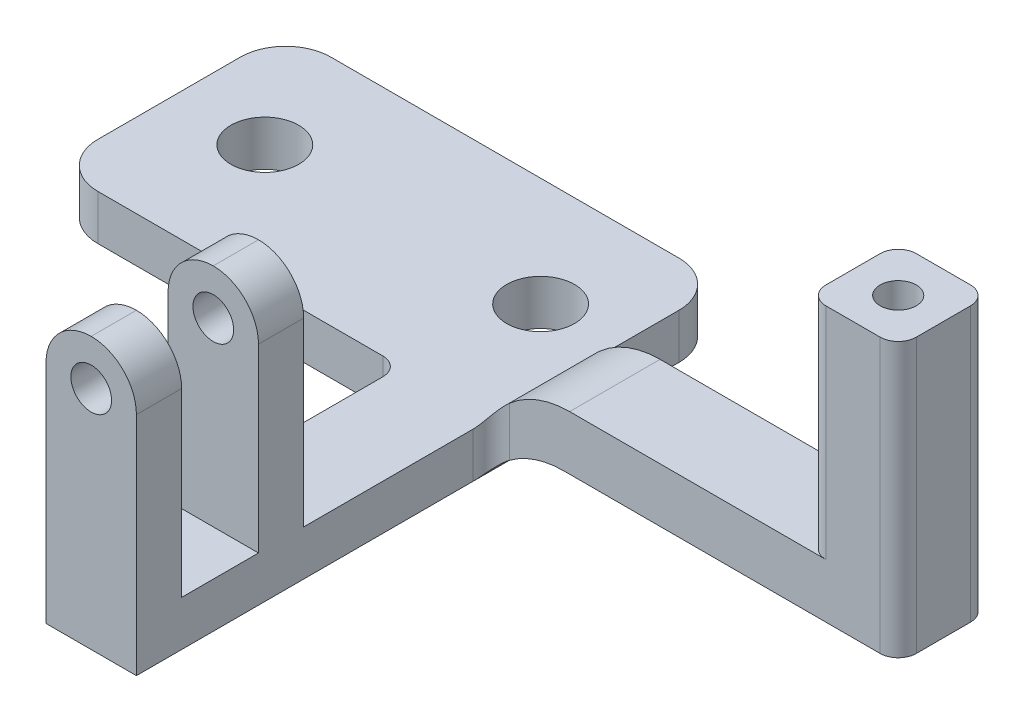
ISO-10303-21;
HEADER;
FILE_DESCRIPTION(('STEP AP214'),'2;1');
FILE_NAME('part.step','',(''),(''),'','','');
FILE_SCHEMA(('AUTOMOTIVE_DESIGN { 1 0 10303 214 1 1 1 1 }'));
ENDSEC;
DATA;
#1=APPLICATION_CONTEXT('core data for automotive mechanical design processes');
#2=APPLICATION_PROTOCOL_DEFINITION('international standard','automotive_design',2000,#1);
#3=PRODUCT_CONTEXT('',#1,'mechanical');
#4=PRODUCT('Part','Part','',(#3));
#5=PRODUCT_RELATED_PRODUCT_CATEGORY('part','',(#4));
#6=PRODUCT_DEFINITION_FORMATION('','',#4);
#7=PRODUCT_DEFINITION_CONTEXT('part definition',#1,'design');
#8=PRODUCT_DEFINITION('design','',#6,#7);
#9=PRODUCT_DEFINITION_SHAPE('','',#8);
#10=(LENGTH_UNIT() NAMED_UNIT(*) SI_UNIT(.MILLI.,.METRE.));
#11=(NAMED_UNIT(*) PLANE_ANGLE_UNIT() SI_UNIT($,.RADIAN.));
#12=(NAMED_UNIT(*) SI_UNIT($,.STERADIAN.) SOLID_ANGLE_UNIT());
#13=UNCERTAINTY_MEASURE_WITH_UNIT(LENGTH_MEASURE(1.E-05),#10,'distance_accuracy_value','');
#14=(GEOMETRIC_REPRESENTATION_CONTEXT(3) GLOBAL_UNCERTAINTY_ASSIGNED_CONTEXT((#13)) GLOBAL_UNIT_ASSIGNED_CONTEXT((#10,
#11,#12)) REPRESENTATION_CONTEXT('',''));
#15=CARTESIAN_POINT('',(0.,0.,0.));
#16=DIRECTION('',(0.,0.,1.));
#17=DIRECTION('',(1.,0.,0.));
#18=AXIS2_PLACEMENT_3D('',#15,#16,#17);
#19=CARTESIAN_POINT('',(48.5,30.,-10.));
#20=DIRECTION('',(-1.,0.,0.));
#21=DIRECTION('',(0.,0.,1.));
#22=AXIS2_PLACEMENT_3D('',#19,#20,#21);
#23=PLANE('',#22);
#24=DIRECTION('',(0.,0.,-1.));
#25=VECTOR('',#24,1.);
#26=CARTESIAN_POINT('',(48.5,0.,0.));
#27=LINE('',#26,#25);
#28=CARTESIAN_POINT('',(48.5,0.,-10.));
#29=VERTEX_POINT('',#28);
#30=CARTESIAN_POINT('',(48.5,0.,-47.25));
#31=VERTEX_POINT('',#30);
#32=EDGE_CURVE('E484',#29,#31,#27,.T.);
#33=ORIENTED_EDGE('',*,*,#32,.T.);
#34=DIRECTION('',(0.,1.,0.));
#35=VECTOR('',#34,1.);
#36=CARTESIAN_POINT('',(48.5,0.,-47.25));
#37=LINE('',#36,#35);
#38=CARTESIAN_POINT('',(48.5,5.,-47.25));
#39=VERTEX_POINT('',#38);
#40=EDGE_CURVE('E507',#31,#39,#37,.T.);
#41=ORIENTED_EDGE('',*,*,#40,.T.);
#42=DIRECTION('',(0.,0.,1.));
#43=VECTOR('',#42,1.);
#44=CARTESIAN_POINT('',(48.5,5.,0.));
#45=LINE('',#44,#43);
#46=CARTESIAN_POINT('',(48.5,5.,-28.5));
#47=VERTEX_POINT('',#46);
#48=EDGE_CURVE('E511',#39,#47,#45,.T.);
#49=ORIENTED_EDGE('',*,*,#48,.T.);
#50=DIRECTION('',(0.,-1.,0.));
#51=VECTOR('',#50,1.);
#52=CARTESIAN_POINT('',(48.5,30.,-28.5));
#53=LINE('',#52,#51);
#54=CARTESIAN_POINT('',(48.5,25.,-28.5));
#55=VERTEX_POINT('',#54);
#56=EDGE_CURVE('E302',#55,#47,#53,.T.);
#57=ORIENTED_EDGE('',*,*,#56,.F.);
#58=DIRECTION('',(0.,0.,-1.));
#59=VECTOR('',#58,1.);
#60=CARTESIAN_POINT('',(48.5,25.,-28.5));
#61=LINE('',#60,#59);
#62=CARTESIAN_POINT('',(48.5,25.,-23.5));
#63=VERTEX_POINT('',#62);
#64=EDGE_CURVE('E362',#55,#63,#61,.F.);
#65=ORIENTED_EDGE('',*,*,#64,.T.);
#66=DIRECTION('',(0.,-1.,0.));
#67=VECTOR('',#66,1.);
#68=CARTESIAN_POINT('',(48.5,30.,-23.5));
#69=LINE('',#68,#67);
#70=CARTESIAN_POINT('',(48.5,5.,-23.5));
#71=VERTEX_POINT('',#70);
#72=EDGE_CURVE('E305',#63,#71,#69,.T.);
#73=ORIENTED_EDGE('',*,*,#72,.T.);
#74=CARTESIAN_POINT('',(48.5,5.,-15.));
#75=VERTEX_POINT('',#74);
#76=EDGE_CURVE('E500',#71,#75,#45,.T.);
#77=ORIENTED_EDGE('',*,*,#76,.T.);
#78=DIRECTION('',(0.,-1.,0.));
#79=VECTOR('',#78,1.);
#80=CARTESIAN_POINT('',(48.5,30.,-15.));
#81=LINE('',#80,#79);
#82=CARTESIAN_POINT('',(48.5,25.,-15.));
#83=VERTEX_POINT('',#82);
#84=EDGE_CURVE('E320',#83,#75,#81,.T.);
#85=ORIENTED_EDGE('',*,*,#84,.F.);
#86=DIRECTION('',(0.,0.,-1.));
#87=VECTOR('',#86,1.);
#88=CARTESIAN_POINT('',(48.5,25.,-10.));
#89=LINE('',#88,#87);
#90=CARTESIAN_POINT('',(48.5,25.,-10.));
#91=VERTEX_POINT('',#90);
#92=EDGE_CURVE('E368',#83,#91,#89,.F.);
#93=ORIENTED_EDGE('',*,*,#92,.T.);
#94=DIRECTION('',(0.,-1.,0.));
#95=VECTOR('',#94,1.);
#96=CARTESIAN_POINT('',(48.5,30.,-10.));
#97=LINE('',#96,#95);
#98=EDGE_CURVE('E323',#91,#29,#97,.T.);
#99=ORIENTED_EDGE('',*,*,#98,.T.);
#100=EDGE_LOOP('',(#33,#41,#49,#57,#65,#73,#77,#85,#93,#99));
#101=FACE_BOUND('',#100,.T.);
#102=ADVANCED_FACE('F35',(#101),#23,.F.);
#103=CARTESIAN_POINT('',(0.,5.,0.));
#104=DIRECTION('',(0.,-1.,0.));
#105=DIRECTION('',(0.,0.,-1.));
#106=AXIS2_PLACEMENT_3D('',#103,#104,#105);
#107=PLANE('',#106);
#108=CARTESIAN_POINT('',(40.25,5.,-62.95));
#109=DIRECTION('',(0.,1.,0.));
#110=DIRECTION('',(0.,0.,1.));
#111=AXIS2_PLACEMENT_3D('',#108,#109,#110);
#112=CIRCLE('',#111,3.75000000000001);
#113=CARTESIAN_POINT('',(40.25,5.,-59.2));
#114=VERTEX_POINT('',#113);
#115=EDGE_CURVE('E328',#114,#114,#112,.T.);
#116=ORIENTED_EDGE('',*,*,#115,.F.);
#117=EDGE_LOOP('',(#116));
#118=FACE_BOUND('',#117,.T.);
#119=CARTESIAN_POINT('',(9.75,5.,-62.95));
#120=DIRECTION('',(0.,1.,0.));
#121=DIRECTION('',(0.,0.,1.));
#122=AXIS2_PLACEMENT_3D('',#119,#120,#121);
#123=CIRCLE('',#122,3.75);
#124=CARTESIAN_POINT('',(9.75,5.,-59.2));
#125=VERTEX_POINT('',#124);
#126=EDGE_CURVE('E334',#125,#125,#123,.T.);
#127=ORIENTED_EDGE('',*,*,#126,.F.);
#128=EDGE_LOOP('',(#127));
#129=FACE_BOUND('',#128,.T.);
#130=DIRECTION('',(0.,0.,1.));
#131=VECTOR('',#130,1.);
#132=CARTESIAN_POINT('',(48.5,5.,0.));
#133=LINE('',#132,#131);
#134=CARTESIAN_POINT('',(48.5,5.,-61.25));
#135=VERTEX_POINT('',#134);
#136=EDGE_CURVE('E582',#135,#39,#133,.T.);
#137=ORIENTED_EDGE('',*,*,#136,.F.);
#138=DIRECTION('',(0.,0.,-1.));
#139=VECTOR('',#138,1.);
#140=CARTESIAN_POINT('',(48.5,5.,0.));
#141=LINE('',#140,#139);
#142=CARTESIAN_POINT('',(48.5,5.,-70.));
#143=VERTEX_POINT('',#142);
#144=EDGE_CURVE('E516',#135,#143,#141,.T.);
#145=ORIENTED_EDGE('',*,*,#144,.T.);
#146=CARTESIAN_POINT('',(43.5,5.,-70.));
#147=DIRECTION('',(0.,-1.,0.));
#148=DIRECTION('',(0.,0.,-1.));
#149=AXIS2_PLACEMENT_3D('',#146,#147,#148);
#150=CIRCLE('',#149,5.);
#151=CARTESIAN_POINT('',(43.5,5.,-75.));
#152=VERTEX_POINT('',#151);
#153=EDGE_CURVE('E390',#143,#152,#150,.F.);
#154=ORIENTED_EDGE('',*,*,#153,.T.);
#155=DIRECTION('',(-1.,0.,0.));
#156=VECTOR('',#155,1.);
#157=CARTESIAN_POINT('',(0.,5.,-75.));
#158=LINE('',#157,#156);
#159=CARTESIAN_POINT('',(5.,5.,-75.));
#160=VERTEX_POINT('',#159);
#161=EDGE_CURVE('E343',#152,#160,#158,.T.);
#162=ORIENTED_EDGE('',*,*,#161,.T.);
#163=CARTESIAN_POINT('',(5.,5.,-70.));
#164=DIRECTION('',(0.,-1.,0.));
#165=DIRECTION('',(0.,0.,-1.));
#166=AXIS2_PLACEMENT_3D('',#163,#164,#165);
#167=CIRCLE('',#166,5.);
#168=CARTESIAN_POINT('',(0.,5.,-70.));
#169=VERTEX_POINT('',#168);
#170=EDGE_CURVE('E388',#160,#169,#167,.F.);
#171=ORIENTED_EDGE('',*,*,#170,.T.);
#172=DIRECTION('',(0.,0.,1.));
#173=VECTOR('',#172,1.);
#174=CARTESIAN_POINT('',(0.,5.,0.));
#175=LINE('',#174,#173);
#176=CARTESIAN_POINT('',(0.,5.,-54.25));
#177=VERTEX_POINT('',#176);
#178=EDGE_CURVE('E340',#169,#177,#175,.T.);
#179=ORIENTED_EDGE('',*,*,#178,.T.);
#180=CARTESIAN_POINT('',(5.,5.,-54.25));
#181=DIRECTION('',(0.,-1.,0.));
#182=DIRECTION('',(0.,0.,-1.));
#183=AXIS2_PLACEMENT_3D('',#180,#181,#182);
#184=CIRCLE('',#183,5.);
#185=CARTESIAN_POINT('',(5.,5.,-49.25));
#186=VERTEX_POINT('',#185);
#187=EDGE_CURVE('E386',#177,#186,#184,.F.);
#188=ORIENTED_EDGE('',*,*,#187,.T.);
#189=DIRECTION('',(-1.,0.,0.));
#190=VECTOR('',#189,1.);
#191=CARTESIAN_POINT('',(0.,5.,-49.25));
#192=LINE('',#191,#190);
#193=CARTESIAN_POINT('',(36.5,5.,-49.25));
#194=VERTEX_POINT('',#193);
#195=EDGE_CURVE('E519',#194,#186,#192,.T.);
#196=ORIENTED_EDGE('',*,*,#195,.F.);
#197=CARTESIAN_POINT('',(36.5,5.,-47.25));
#198=DIRECTION('',(0.,-1.,0.));
#199=DIRECTION('',(0.,0.,-1.));
#200=AXIS2_PLACEMENT_3D('',#197,#198,#199);
#201=CIRCLE('',#200,2.00000000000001);
#202=CARTESIAN_POINT('',(38.5,5.,-47.25));
#203=VERTEX_POINT('',#202);
#204=EDGE_CURVE('E522',#203,#194,#201,.F.);
#205=ORIENTED_EDGE('',*,*,#204,.F.);
#206=DIRECTION('',(0.,0.,1.));
#207=VECTOR('',#206,1.);
#208=CARTESIAN_POINT('',(38.5,5.,0.));
#209=LINE('',#208,#207);
#210=CARTESIAN_POINT('',(38.5,5.,-28.5));
#211=VERTEX_POINT('',#210);
#212=EDGE_CURVE('E514',#203,#211,#209,.T.);
#213=ORIENTED_EDGE('',*,*,#212,.T.);
#214=DIRECTION('',(-1.,0.,0.));
#215=VECTOR('',#214,1.);
#216=CARTESIAN_POINT('',(38.5,5.,-28.5));
#217=LINE('',#216,#215);
#218=EDGE_CURVE('E295',#47,#211,#217,.T.);
#219=ORIENTED_EDGE('',*,*,#218,.F.);
#220=ORIENTED_EDGE('',*,*,#48,.F.);
#221=EDGE_LOOP('',(#137,#145,#154,#162,#171,#179,#188,#196,#205,#213,#219,#220));
#222=FACE_BOUND('',#221,.T.);
#223=ADVANCED_FACE('F615',(#118,#129,#222),#107,.F.);
#224=CARTESIAN_POINT('',(0.,5.,0.));
#225=DIRECTION('',(1.,0.,0.));
#226=DIRECTION('',(0.,0.,-1.));
#227=AXIS2_PLACEMENT_3D('',#224,#225,#226);
#228=PLANE('',#227);
#229=ORIENTED_EDGE('',*,*,#178,.F.);
#230=DIRECTION('',(0.,-1.,0.));
#231=VECTOR('',#230,1.);
#232=CARTESIAN_POINT('',(0.,5.,-70.));
#233=LINE('',#232,#231);
#234=CARTESIAN_POINT('',(0.,0.,-70.));
#235=VERTEX_POINT('',#234);
#236=EDGE_CURVE('E406',#169,#235,#233,.T.);
#237=ORIENTED_EDGE('',*,*,#236,.T.);
#238=DIRECTION('',(0.,0.,1.));
#239=VECTOR('',#238,1.);
#240=CARTESIAN_POINT('',(0.,0.,0.));
#241=LINE('',#240,#239);
#242=CARTESIAN_POINT('',(0.,0.,-54.25));
#243=VERTEX_POINT('',#242);
#244=EDGE_CURVE('E337',#235,#243,#241,.T.);
#245=ORIENTED_EDGE('',*,*,#244,.T.);
#246=DIRECTION('',(0.,1.,0.));
#247=VECTOR('',#246,1.);
#248=CARTESIAN_POINT('',(0.,5.,-54.25));
#249=LINE('',#248,#247);
#250=EDGE_CURVE('E403',#243,#177,#249,.T.);
#251=ORIENTED_EDGE('',*,*,#250,.T.);
#252=EDGE_LOOP('',(#229,#237,#245,#251));
#253=FACE_BOUND('',#252,.T.);
#254=ADVANCED_FACE('F621',(#253),#228,.F.);
#255=DIRECTION('',(1.,0.,0.));
#256=VECTOR('',#255,1.);
#257=CARTESIAN_POINT('',(38.5,5.,-23.5));
#258=LINE('',#257,#256);
#259=CARTESIAN_POINT('',(38.5,5.,-23.5));
#260=VERTEX_POINT('',#259);
#261=EDGE_CURVE('E298',#260,#71,#258,.T.);
#262=ORIENTED_EDGE('',*,*,#261,.F.);
#263=CARTESIAN_POINT('',(38.5,5.,-15.));
#264=VERTEX_POINT('',#263);
#265=EDGE_CURVE('E513',#260,#264,#209,.T.);
#266=ORIENTED_EDGE('',*,*,#265,.T.);
#267=DIRECTION('',(-1.,0.,0.));
#268=VECTOR('',#267,1.);
#269=CARTESIAN_POINT('',(38.5,5.,-15.));
#270=LINE('',#269,#268);
#271=EDGE_CURVE('E314',#75,#264,#270,.T.);
#272=ORIENTED_EDGE('',*,*,#271,.F.);
#273=ORIENTED_EDGE('',*,*,#76,.F.);
#274=EDGE_LOOP('',(#262,#266,#272,#273));
#275=FACE_BOUND('',#274,.T.);
#276=ADVANCED_FACE('F624',(#275),#107,.F.);
#277=CARTESIAN_POINT('',(0.,0.,0.));
#278=DIRECTION('',(0.,-1.,0.));
#279=DIRECTION('',(0.,0.,-1.));
#280=AXIS2_PLACEMENT_3D('',#277,#278,#279);
#281=PLANE('',#280);
#282=CARTESIAN_POINT('',(43.5,0.,-70.));
#283=DIRECTION('',(0.,-1.,0.));
#284=DIRECTION('',(0.,0.,-1.));
#285=AXIS2_PLACEMENT_3D('',#282,#283,#284);
#286=CIRCLE('',#285,5.);
#287=CARTESIAN_POINT('',(43.5,0.,-75.));
#288=VERTEX_POINT('',#287);
#289=CARTESIAN_POINT('',(48.5,0.,-70.));
#290=VERTEX_POINT('',#289);
#291=EDGE_CURVE('E400',#288,#290,#286,.T.);
#292=ORIENTED_EDGE('',*,*,#291,.T.);
#293=CARTESIAN_POINT('',(48.5,0.,-61.25));
#294=VERTEX_POINT('',#293);
#295=EDGE_CURVE('E415',#294,#290,#27,.T.);
#296=ORIENTED_EDGE('',*,*,#295,.F.);
#297=EDGE_CURVE('E470',#31,#294,#27,.T.);
#298=ORIENTED_EDGE('',*,*,#297,.F.);
#299=ORIENTED_EDGE('',*,*,#32,.F.);
#300=DIRECTION('',(-1.,0.,0.));
#301=VECTOR('',#300,1.);
#302=CARTESIAN_POINT('',(0.,0.,-9.99999999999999));
#303=LINE('',#302,#301);
#304=CARTESIAN_POINT('',(38.5,0.,-10.));
#305=VERTEX_POINT('',#304);
#306=EDGE_CURVE('E487',#29,#305,#303,.T.);
#307=ORIENTED_EDGE('',*,*,#306,.T.);
#308=DIRECTION('',(0.,0.,-1.));
#309=VECTOR('',#308,1.);
#310=CARTESIAN_POINT('',(38.5,0.,0.));
#311=LINE('',#310,#309);
#312=CARTESIAN_POINT('',(38.5,0.,-47.25));
#313=VERTEX_POINT('',#312);
#314=EDGE_CURVE('E490',#305,#313,#311,.T.);
#315=ORIENTED_EDGE('',*,*,#314,.T.);
#316=CARTESIAN_POINT('',(36.5,0.,-47.25));
#317=DIRECTION('',(0.,1.,0.));
#318=DIRECTION('',(0.,0.,1.));
#319=AXIS2_PLACEMENT_3D('',#316,#317,#318);
#320=CIRCLE('',#319,2.00000000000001);
#321=CARTESIAN_POINT('',(36.5,0.,-49.25));
#322=VERTEX_POINT('',#321);
#323=EDGE_CURVE('E492',#322,#313,#320,.F.);
#324=ORIENTED_EDGE('',*,*,#323,.F.);
#325=DIRECTION('',(1.,0.,0.));
#326=VECTOR('',#325,1.);
#327=CARTESIAN_POINT('',(0.,0.,-49.25));
#328=LINE('',#327,#326);
#329=CARTESIAN_POINT('',(5.,0.,-49.25));
#330=VERTEX_POINT('',#329);
#331=EDGE_CURVE('E497',#330,#322,#328,.T.);
#332=ORIENTED_EDGE('',*,*,#331,.F.);
#333=CARTESIAN_POINT('',(5.,0.,-54.25));
#334=DIRECTION('',(0.,-1.,0.));
#335=DIRECTION('',(0.,0.,-1.));
#336=AXIS2_PLACEMENT_3D('',#333,#334,#335);
#337=CIRCLE('',#336,5.);
#338=EDGE_CURVE('E396',#330,#243,#337,.T.);
#339=ORIENTED_EDGE('',*,*,#338,.T.);
#340=ORIENTED_EDGE('',*,*,#244,.F.);
#341=CARTESIAN_POINT('',(5.,0.,-70.));
#342=DIRECTION('',(0.,-1.,0.));
#343=DIRECTION('',(0.,0.,-1.));
#344=AXIS2_PLACEMENT_3D('',#341,#342,#343);
#345=CIRCLE('',#344,5.);
#346=CARTESIAN_POINT('',(5.,0.,-75.));
#347=VERTEX_POINT('',#346);
#348=EDGE_CURVE('E398',#235,#347,#345,.T.);
#349=ORIENTED_EDGE('',*,*,#348,.T.);
#350=DIRECTION('',(-1.,0.,0.));
#351=VECTOR('',#350,1.);
#352=CARTESIAN_POINT('',(0.,0.,-75.));
#353=LINE('',#352,#351);
#354=EDGE_CURVE('E344',#288,#347,#353,.T.);
#355=ORIENTED_EDGE('',*,*,#354,.F.);
#356=EDGE_LOOP('',(#292,#296,#298,#299,#307,#315,#324,#332,#339,#340,#349,#355));
#357=FACE_BOUND('',#356,.T.);
#358=CARTESIAN_POINT('',(9.75,0.,-62.95));
#359=DIRECTION('',(0.,1.,0.));
#360=DIRECTION('',(0.,0.,1.));
#361=AXIS2_PLACEMENT_3D('',#358,#359,#360);
#362=CIRCLE('',#361,3.75);
#363=CARTESIAN_POINT('',(9.75,0.,-59.2));
#364=VERTEX_POINT('',#363);
#365=EDGE_CURVE('E331',#364,#364,#362,.T.);
#366=ORIENTED_EDGE('',*,*,#365,.T.);
#367=EDGE_LOOP('',(#366));
#368=FACE_BOUND('',#367,.T.);
#369=CARTESIAN_POINT('',(40.25,0.,-62.95));
#370=DIRECTION('',(0.,1.,0.));
#371=DIRECTION('',(0.,0.,1.));
#372=AXIS2_PLACEMENT_3D('',#369,#370,#371);
#373=CIRCLE('',#372,3.75000000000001);
#374=CARTESIAN_POINT('',(40.25,0.,-59.2));
#375=VERTEX_POINT('',#374);
#376=EDGE_CURVE('E327',#375,#375,#373,.T.);
#377=ORIENTED_EDGE('',*,*,#376,.T.);
#378=EDGE_LOOP('',(#377));
#379=FACE_BOUND('',#378,.T.);
#380=ADVANCED_FACE('F475',(#357,#368,#379),#281,.T.);
#381=CARTESIAN_POINT('',(0.,5.,-75.));
#382=DIRECTION('',(0.,0.,1.));
#383=DIRECTION('',(1.,0.,0.));
#384=AXIS2_PLACEMENT_3D('',#381,#382,#383);
#385=PLANE('',#384);
#386=ORIENTED_EDGE('',*,*,#161,.F.);
#387=DIRECTION('',(0.,1.,0.));
#388=VECTOR('',#387,1.);
#389=CARTESIAN_POINT('',(43.5,5.,-75.));
#390=LINE('',#389,#388);
#391=EDGE_CURVE('E394',#152,#288,#390,.F.);
#392=ORIENTED_EDGE('',*,*,#391,.T.);
#393=ORIENTED_EDGE('',*,*,#354,.T.);
#394=DIRECTION('',(0.,-1.,0.));
#395=VECTOR('',#394,1.);
#396=CARTESIAN_POINT('',(5.,5.,-75.));
#397=LINE('',#396,#395);
#398=EDGE_CURVE('E392',#347,#160,#397,.F.);
#399=ORIENTED_EDGE('',*,*,#398,.T.);
#400=EDGE_LOOP('',(#386,#392,#393,#399));
#401=FACE_BOUND('',#400,.T.);
#402=ADVANCED_FACE('F703',(#401),#385,.F.);
#403=CARTESIAN_POINT('',(9.75,5.,-62.95));
#404=DIRECTION('',(0.,-1.,0.));
#405=DIRECTION('',(0.,0.,-1.));
#406=AXIS2_PLACEMENT_3D('',#403,#404,#405);
#407=CYLINDRICAL_SURFACE('',#406,3.75);
#408=ORIENTED_EDGE('',*,*,#126,.T.);
#409=EDGE_LOOP('',(#408));
#410=FACE_BOUND('',#409,.T.);
#411=ORIENTED_EDGE('',*,*,#365,.F.);
#412=EDGE_LOOP('',(#411));
#413=FACE_BOUND('',#412,.T.);
#414=ADVANCED_FACE('F796',(#410,#413),#407,.F.);
#415=CARTESIAN_POINT('',(40.25,5.,-62.95));
#416=DIRECTION('',(0.,-1.,0.));
#417=DIRECTION('',(0.,0.,-1.));
#418=AXIS2_PLACEMENT_3D('',#415,#416,#417);
#419=CYLINDRICAL_SURFACE('',#418,3.75000000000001);
#420=ORIENTED_EDGE('',*,*,#115,.T.);
#421=EDGE_LOOP('',(#420));
#422=FACE_BOUND('',#421,.T.);
#423=ORIENTED_EDGE('',*,*,#376,.F.);
#424=EDGE_LOOP('',(#423));
#425=FACE_BOUND('',#424,.T.);
#426=ADVANCED_FACE('F802',(#422,#425),#419,.F.);
#427=CARTESIAN_POINT('',(38.5,30.,-10.));
#428=DIRECTION('',(1.,0.,0.));
#429=DIRECTION('',(0.,0.,-1.));
#430=AXIS2_PLACEMENT_3D('',#427,#428,#429);
#431=PLANE('',#430);
#432=DIRECTION('',(0.,1.,0.));
#433=VECTOR('',#432,1.);
#434=CARTESIAN_POINT('',(38.5,0.,-47.25));
#435=LINE('',#434,#433);
#436=EDGE_CURVE('E504',#313,#203,#435,.T.);
#437=ORIENTED_EDGE('',*,*,#436,.F.);
#438=ORIENTED_EDGE('',*,*,#314,.F.);
#439=DIRECTION('',(0.,-1.,0.));
#440=VECTOR('',#439,1.);
#441=CARTESIAN_POINT('',(38.5,30.,-10.));
#442=LINE('',#441,#440);
#443=CARTESIAN_POINT('',(38.5,25.,-10.));
#444=VERTEX_POINT('',#443);
#445=EDGE_CURVE('E325',#444,#305,#442,.T.);
#446=ORIENTED_EDGE('',*,*,#445,.F.);
#447=DIRECTION('',(0.,0.,1.));
#448=VECTOR('',#447,1.);
#449=CARTESIAN_POINT('',(38.5,25.,-10.));
#450=LINE('',#449,#448);
#451=CARTESIAN_POINT('',(38.5,25.,-15.));
#452=VERTEX_POINT('',#451);
#453=EDGE_CURVE('E375',#444,#452,#450,.F.);
#454=ORIENTED_EDGE('',*,*,#453,.T.);
#455=DIRECTION('',(0.,-1.,0.));
#456=VECTOR('',#455,1.);
#457=CARTESIAN_POINT('',(38.5,30.,-15.));
#458=LINE('',#457,#456);
#459=EDGE_CURVE('E317',#452,#264,#458,.T.);
#460=ORIENTED_EDGE('',*,*,#459,.T.);
#461=ORIENTED_EDGE('',*,*,#265,.F.);
#462=DIRECTION('',(0.,-1.,0.));
#463=VECTOR('',#462,1.);
#464=CARTESIAN_POINT('',(38.5,30.,-23.5));
#465=LINE('',#464,#463);
#466=CARTESIAN_POINT('',(38.5,25.,-23.5));
#467=VERTEX_POINT('',#466);
#468=EDGE_CURVE('E308',#467,#260,#465,.T.);
#469=ORIENTED_EDGE('',*,*,#468,.F.);
#470=DIRECTION('',(0.,0.,1.));
#471=VECTOR('',#470,1.);
#472=CARTESIAN_POINT('',(38.5,25.,-28.5));
#473=LINE('',#472,#471);
#474=CARTESIAN_POINT('',(38.5,25.,-28.5));
#475=VERTEX_POINT('',#474);
#476=EDGE_CURVE('E355',#467,#475,#473,.F.);
#477=ORIENTED_EDGE('',*,*,#476,.T.);
#478=DIRECTION('',(0.,-1.,0.));
#479=VECTOR('',#478,1.);
#480=CARTESIAN_POINT('',(38.5,30.,-28.5));
#481=LINE('',#480,#479);
#482=EDGE_CURVE('E311',#475,#211,#481,.T.);
#483=ORIENTED_EDGE('',*,*,#482,.T.);
#484=ORIENTED_EDGE('',*,*,#212,.F.);
#485=EDGE_LOOP('',(#437,#438,#446,#454,#460,#461,#469,#477,#483,#484));
#486=FACE_BOUND('',#485,.T.);
#487=ADVANCED_FACE('F636',(#486),#431,.F.);
#488=CARTESIAN_POINT('',(38.5,30.,-10.));
#489=DIRECTION('',(0.,0.,-1.));
#490=DIRECTION('',(-1.,0.,0.));
#491=AXIS2_PLACEMENT_3D('',#488,#489,#490);
#492=PLANE('',#491);
#493=CARTESIAN_POINT('',(43.5,25.,-9.99999999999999));
#494=DIRECTION('',(0.,0.,-1.));
#495=DIRECTION('',(-1.,0.,0.));
#496=AXIS2_PLACEMENT_3D('',#493,#494,#495);
#497=CIRCLE('',#496,2.25);
#498=CARTESIAN_POINT('',(41.25,25.,-9.99999999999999));
#499=VERTEX_POINT('',#498);
#500=EDGE_CURVE('E291',#499,#499,#497,.T.);
#501=ORIENTED_EDGE('',*,*,#500,.T.);
#502=EDGE_LOOP('',(#501));
#503=FACE_BOUND('',#502,.T.);
#504=ORIENTED_EDGE('',*,*,#98,.F.);
#505=CARTESIAN_POINT('',(43.5,25.,-10.));
#506=DIRECTION('',(0.,0.,-1.));
#507=DIRECTION('',(-1.,0.,0.));
#508=AXIS2_PLACEMENT_3D('',#505,#506,#507);
#509=CIRCLE('',#508,5.);
#510=CARTESIAN_POINT('',(43.5,30.,-10.));
#511=VERTEX_POINT('',#510);
#512=EDGE_CURVE('E373',#91,#511,#509,.F.);
#513=ORIENTED_EDGE('',*,*,#512,.T.);
#514=CARTESIAN_POINT('',(43.5,25.,-10.));
#515=DIRECTION('',(0.,0.,-1.));
#516=DIRECTION('',(-1.,0.,0.));
#517=AXIS2_PLACEMENT_3D('',#514,#515,#516);
#518=CIRCLE('',#517,5.);
#519=EDGE_CURVE('E371',#511,#444,#518,.F.);
#520=ORIENTED_EDGE('',*,*,#519,.T.);
#521=ORIENTED_EDGE('',*,*,#445,.T.);
#522=ORIENTED_EDGE('',*,*,#306,.F.);
#523=EDGE_LOOP('',(#504,#513,#520,#521,#522));
#524=FACE_BOUND('',#523,.T.);
#525=ADVANCED_FACE('F629',(#503,#524),#492,.F.);
#526=DIRECTION('',(0.,1.,0.));
#527=VECTOR('',#526,1.);
#528=CARTESIAN_POINT('',(48.5,0.,-61.25));
#529=LINE('',#528,#527);
#530=EDGE_CURVE('E472',#294,#135,#529,.T.);
#531=ORIENTED_EDGE('',*,*,#530,.F.);
#532=ORIENTED_EDGE('',*,*,#295,.T.);
#533=DIRECTION('',(0.,1.,0.));
#534=VECTOR('',#533,1.);
#535=CARTESIAN_POINT('',(48.5,0.,-70.));
#536=LINE('',#535,#534);
#537=EDGE_CURVE('E377',#290,#143,#536,.T.);
#538=ORIENTED_EDGE('',*,*,#537,.T.);
#539=ORIENTED_EDGE('',*,*,#144,.F.);
#540=EDGE_LOOP('',(#531,#532,#538,#539));
#541=FACE_BOUND('',#540,.T.);
#542=ADVANCED_FACE('F617',(#541),#23,.F.);
#543=CARTESIAN_POINT('',(38.5,30.,-15.));
#544=DIRECTION('',(0.,0.,1.));
#545=DIRECTION('',(1.,0.,0.));
#546=AXIS2_PLACEMENT_3D('',#543,#544,#545);
#547=PLANE('',#546);
#548=CARTESIAN_POINT('',(43.5,25.,-15.));
#549=DIRECTION('',(0.,0.,1.));
#550=DIRECTION('',(1.,0.,0.));
#551=AXIS2_PLACEMENT_3D('',#548,#549,#550);
#552=CIRCLE('',#551,2.25);
#553=CARTESIAN_POINT('',(45.75,25.,-15.));
#554=VERTEX_POINT('',#553);
#555=EDGE_CURVE('E288',#554,#554,#552,.T.);
#556=ORIENTED_EDGE('',*,*,#555,.T.);
#557=EDGE_LOOP('',(#556));
#558=FACE_BOUND('',#557,.T.);
#559=CARTESIAN_POINT('',(43.5,25.,-15.));
#560=DIRECTION('',(0.,0.,1.));
#561=DIRECTION('',(1.,0.,0.));
#562=AXIS2_PLACEMENT_3D('',#559,#560,#561);
#563=CIRCLE('',#562,5.);
#564=CARTESIAN_POINT('',(43.5,30.,-15.));
#565=VERTEX_POINT('',#564);
#566=EDGE_CURVE('E364',#452,#565,#563,.F.);
#567=ORIENTED_EDGE('',*,*,#566,.T.);
#568=CARTESIAN_POINT('',(43.5,25.,-15.));
#569=DIRECTION('',(0.,0.,1.));
#570=DIRECTION('',(1.,0.,0.));
#571=AXIS2_PLACEMENT_3D('',#568,#569,#570);
#572=CIRCLE('',#571,5.);
#573=EDGE_CURVE('E366',#565,#83,#572,.F.);
#574=ORIENTED_EDGE('',*,*,#573,.T.);
#575=ORIENTED_EDGE('',*,*,#84,.T.);
#576=ORIENTED_EDGE('',*,*,#271,.T.);
#577=ORIENTED_EDGE('',*,*,#459,.F.);
#578=EDGE_LOOP('',(#567,#574,#575,#576,#577));
#579=FACE_BOUND('',#578,.T.);
#580=ADVANCED_FACE('F628',(#558,#579),#547,.F.);
#581=CARTESIAN_POINT('',(38.5,30.,-28.5));
#582=DIRECTION('',(0.,0.,1.));
#583=DIRECTION('',(1.,0.,0.));
#584=AXIS2_PLACEMENT_3D('',#581,#582,#583);
#585=PLANE('',#584);
#586=CARTESIAN_POINT('',(43.5,25.,-28.5));
#587=DIRECTION('',(0.,0.,1.));
#588=DIRECTION('',(1.,0.,0.));
#589=AXIS2_PLACEMENT_3D('',#586,#587,#588);
#590=CIRCLE('',#589,2.25);
#591=CARTESIAN_POINT('',(45.75,25.,-28.5));
#592=VERTEX_POINT('',#591);
#593=EDGE_CURVE('E285',#592,#592,#590,.T.);
#594=ORIENTED_EDGE('',*,*,#593,.T.);
#595=EDGE_LOOP('',(#594));
#596=FACE_BOUND('',#595,.T.);
#597=ORIENTED_EDGE('',*,*,#482,.F.);
#598=CARTESIAN_POINT('',(43.5,25.,-28.5));
#599=DIRECTION('',(0.,0.,1.));
#600=DIRECTION('',(1.,0.,0.));
#601=AXIS2_PLACEMENT_3D('',#598,#599,#600);
#602=CIRCLE('',#601,5.);
#603=CARTESIAN_POINT('',(43.5,30.,-28.5));
#604=VERTEX_POINT('',#603);
#605=EDGE_CURVE('E360',#475,#604,#602,.F.);
#606=ORIENTED_EDGE('',*,*,#605,.T.);
#607=CARTESIAN_POINT('',(43.5,25.,-28.5));
#608=DIRECTION('',(0.,0.,1.));
#609=DIRECTION('',(1.,0.,0.));
#610=AXIS2_PLACEMENT_3D('',#607,#608,#609);
#611=CIRCLE('',#610,5.);
#612=EDGE_CURVE('E358',#604,#55,#611,.F.);
#613=ORIENTED_EDGE('',*,*,#612,.T.);
#614=ORIENTED_EDGE('',*,*,#56,.T.);
#615=ORIENTED_EDGE('',*,*,#218,.T.);
#616=EDGE_LOOP('',(#597,#606,#613,#614,#615));
#617=FACE_BOUND('',#616,.T.);
#618=ADVANCED_FACE('F634',(#596,#617),#585,.F.);
#619=CARTESIAN_POINT('',(38.5,30.,-23.5));
#620=DIRECTION('',(0.,0.,-1.));
#621=DIRECTION('',(-1.,0.,0.));
#622=AXIS2_PLACEMENT_3D('',#619,#620,#621);
#623=PLANE('',#622);
#624=CARTESIAN_POINT('',(43.5,25.,-23.5));
#625=DIRECTION('',(0.,0.,-1.));
#626=DIRECTION('',(-1.,0.,0.));
#627=AXIS2_PLACEMENT_3D('',#624,#625,#626);
#628=CIRCLE('',#627,2.25);
#629=CARTESIAN_POINT('',(41.25,25.,-23.5));
#630=VERTEX_POINT('',#629);
#631=EDGE_CURVE('E284',#630,#630,#628,.T.);
#632=ORIENTED_EDGE('',*,*,#631,.T.);
#633=EDGE_LOOP('',(#632));
#634=FACE_BOUND('',#633,.T.);
#635=CARTESIAN_POINT('',(43.5,25.,-23.5));
#636=DIRECTION('',(0.,0.,-1.));
#637=DIRECTION('',(-1.,0.,0.));
#638=AXIS2_PLACEMENT_3D('',#635,#636,#637);
#639=CIRCLE('',#638,5.);
#640=CARTESIAN_POINT('',(43.5,30.,-23.5));
#641=VERTEX_POINT('',#640);
#642=EDGE_CURVE('E347',#63,#641,#639,.F.);
#643=ORIENTED_EDGE('',*,*,#642,.T.);
#644=CARTESIAN_POINT('',(43.5,25.,-23.5));
#645=DIRECTION('',(0.,0.,-1.));
#646=DIRECTION('',(-1.,0.,0.));
#647=AXIS2_PLACEMENT_3D('',#644,#645,#646);
#648=CIRCLE('',#647,5.);
#649=EDGE_CURVE('E353',#641,#467,#648,.F.);
#650=ORIENTED_EDGE('',*,*,#649,.T.);
#651=ORIENTED_EDGE('',*,*,#468,.T.);
#652=ORIENTED_EDGE('',*,*,#261,.T.);
#653=ORIENTED_EDGE('',*,*,#72,.F.);
#654=EDGE_LOOP('',(#643,#650,#651,#652,#653));
#655=FACE_BOUND('',#654,.T.);
#656=ADVANCED_FACE('F665',(#634,#655),#623,.F.);
#657=CARTESIAN_POINT('',(43.5,25.,0.));
#658=DIRECTION('',(0.,0.,-1.));
#659=DIRECTION('',(-1.,0.,0.));
#660=AXIS2_PLACEMENT_3D('',#657,#658,#659);
#661=CYLINDRICAL_SURFACE('',#660,5.);
#662=ORIENTED_EDGE('',*,*,#64,.F.);
#663=ORIENTED_EDGE('',*,*,#612,.F.);
#664=DIRECTION('',(0.,0.,-1.));
#665=VECTOR('',#664,1.);
#666=CARTESIAN_POINT('',(43.5,30.,0.));
#667=LINE('',#666,#665);
#668=EDGE_CURVE('E299',#641,#604,#667,.T.);
#669=ORIENTED_EDGE('',*,*,#668,.F.);
#670=ORIENTED_EDGE('',*,*,#642,.F.);
#671=EDGE_LOOP('',(#662,#663,#669,#670));
#672=FACE_BOUND('',#671,.T.);
#673=ADVANCED_FACE('F660',(#672),#661,.T.);
#674=CARTESIAN_POINT('',(43.5,25.,0.));
#675=DIRECTION('',(0.,0.,1.));
#676=DIRECTION('',(1.,0.,0.));
#677=AXIS2_PLACEMENT_3D('',#674,#675,#676);
#678=CYLINDRICAL_SURFACE('',#677,5.);
#679=ORIENTED_EDGE('',*,*,#605,.F.);
#680=ORIENTED_EDGE('',*,*,#476,.F.);
#681=ORIENTED_EDGE('',*,*,#649,.F.);
#682=ORIENTED_EDGE('',*,*,#668,.T.);
#683=EDGE_LOOP('',(#679,#680,#681,#682));
#684=FACE_BOUND('',#683,.T.);
#685=ADVANCED_FACE('F663',(#684),#678,.T.);
#686=CARTESIAN_POINT('',(43.5,25.,0.));
#687=DIRECTION('',(0.,0.,1.));
#688=DIRECTION('',(1.,0.,0.));
#689=AXIS2_PLACEMENT_3D('',#686,#687,#688);
#690=CYLINDRICAL_SURFACE('',#689,5.);
#691=ORIENTED_EDGE('',*,*,#453,.F.);
#692=ORIENTED_EDGE('',*,*,#519,.F.);
#693=DIRECTION('',(0.,0.,1.));
#694=VECTOR('',#693,1.);
#695=CARTESIAN_POINT('',(43.5,30.,0.));
#696=LINE('',#695,#694);
#697=EDGE_CURVE('E294',#565,#511,#696,.T.);
#698=ORIENTED_EDGE('',*,*,#697,.F.);
#699=ORIENTED_EDGE('',*,*,#566,.F.);
#700=EDGE_LOOP('',(#691,#692,#698,#699));
#701=FACE_BOUND('',#700,.T.);
#702=ADVANCED_FACE('F717',(#701),#690,.T.);
#703=CARTESIAN_POINT('',(43.5,25.,0.));
#704=DIRECTION('',(0.,0.,-1.));
#705=DIRECTION('',(-1.,0.,0.));
#706=AXIS2_PLACEMENT_3D('',#703,#704,#705);
#707=CYLINDRICAL_SURFACE('',#706,5.);
#708=ORIENTED_EDGE('',*,*,#512,.F.);
#709=ORIENTED_EDGE('',*,*,#92,.F.);
#710=ORIENTED_EDGE('',*,*,#573,.F.);
#711=ORIENTED_EDGE('',*,*,#697,.T.);
#712=EDGE_LOOP('',(#708,#709,#710,#711));
#713=FACE_BOUND('',#712,.T.);
#714=ADVANCED_FACE('F678',(#713),#707,.T.);
#715=CARTESIAN_POINT('',(43.5,25.,-75.));
#716=DIRECTION('',(0.,0.,1.));
#717=DIRECTION('',(1.,0.,0.));
#718=AXIS2_PLACEMENT_3D('',#715,#716,#717);
#719=CYLINDRICAL_SURFACE('',#718,2.25);
#720=ORIENTED_EDGE('',*,*,#631,.F.);
#721=EDGE_LOOP('',(#720));
#722=FACE_BOUND('',#721,.T.);
#723=ORIENTED_EDGE('',*,*,#593,.F.);
#724=EDGE_LOOP('',(#723));
#725=FACE_BOUND('',#724,.T.);
#726=ADVANCED_FACE('F766',(#722,#725),#719,.F.);
#727=ORIENTED_EDGE('',*,*,#555,.F.);
#728=EDGE_LOOP('',(#727));
#729=FACE_BOUND('',#728,.T.);
#730=ORIENTED_EDGE('',*,*,#500,.F.);
#731=EDGE_LOOP('',(#730));
#732=FACE_BOUND('',#731,.T.);
#733=ADVANCED_FACE('F762',(#729,#732),#719,.F.);
#734=CARTESIAN_POINT('',(83.5,34.3,-57.25));
#735=DIRECTION('',(1.,0.,0.));
#736=DIRECTION('',(0.,0.,-1.));
#737=AXIS2_PLACEMENT_3D('',#734,#735,#736);
#738=PLANE('',#737);
#739=DIRECTION('',(0.,-1.,0.));
#740=VECTOR('',#739,1.);
#741=CARTESIAN_POINT('',(83.5,34.3,-57.25));
#742=LINE('',#741,#740);
#743=CARTESIAN_POINT('',(83.5,34.3,-57.25));
#744=VERTEX_POINT('',#743);
#745=CARTESIAN_POINT('',(83.5,10.,-57.25));
#746=VERTEX_POINT('',#745);
#747=EDGE_CURVE('E549',#744,#746,#742,.T.);
#748=ORIENTED_EDGE('',*,*,#747,.T.);
#749=DIRECTION('',(0.,0.,-1.));
#750=VECTOR('',#749,1.);
#751=CARTESIAN_POINT('',(83.4999999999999,10.,1.93132546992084E-13));
#752=LINE('',#751,#750);
#753=CARTESIAN_POINT('',(83.5,10.,-51.25));
#754=VERTEX_POINT('',#753);
#755=EDGE_CURVE('E578',#754,#746,#752,.T.);
#756=ORIENTED_EDGE('',*,*,#755,.F.);
#757=DIRECTION('',(0.,-1.,0.));
#758=VECTOR('',#757,1.);
#759=CARTESIAN_POINT('',(83.5,34.3,-51.25));
#760=LINE('',#759,#758);
#761=CARTESIAN_POINT('',(83.5,34.3,-51.25));
#762=VERTEX_POINT('',#761);
#763=EDGE_CURVE('E276',#762,#754,#760,.T.);
#764=ORIENTED_EDGE('',*,*,#763,.F.);
#765=DIRECTION('',(0.,0.,1.));
#766=VECTOR('',#765,1.);
#767=CARTESIAN_POINT('',(83.5,34.3,-57.25));
#768=LINE('',#767,#766);
#769=EDGE_CURVE('E530',#744,#762,#768,.T.);
#770=ORIENTED_EDGE('',*,*,#769,.F.);
#771=EDGE_LOOP('',(#748,#756,#764,#770));
#772=FACE_BOUND('',#771,.T.);
#773=ADVANCED_FACE('F759',(#772),#738,.F.);
#774=CARTESIAN_POINT('',(85.5,34.3,-51.25));
#775=DIRECTION('',(0.,-1.,0.));
#776=DIRECTION('',(0.,0.,-1.));
#777=AXIS2_PLACEMENT_3D('',#774,#775,#776);
#778=CYLINDRICAL_SURFACE('',#777,2.);
#779=ORIENTED_EDGE('',*,*,#763,.T.);
#780=CARTESIAN_POINT('',(85.5,10.,-51.25));
#781=DIRECTION('',(0.,1.,0.));
#782=DIRECTION('',(0.,0.,1.));
#783=AXIS2_PLACEMENT_3D('',#780,#781,#782);
#784=CIRCLE('',#783,2.);
#785=CARTESIAN_POINT('',(85.5,10.,-49.25));
#786=VERTEX_POINT('',#785);
#787=EDGE_CURVE('E574',#786,#754,#784,.F.);
#788=ORIENTED_EDGE('',*,*,#787,.F.);
#789=DIRECTION('',(0.,-1.,0.));
#790=VECTOR('',#789,1.);
#791=CARTESIAN_POINT('',(85.5,34.3,-49.25));
#792=LINE('',#791,#790);
#793=CARTESIAN_POINT('',(85.5,34.3,-49.25));
#794=VERTEX_POINT('',#793);
#795=EDGE_CURVE('E272',#794,#786,#792,.T.);
#796=ORIENTED_EDGE('',*,*,#795,.F.);
#797=CARTESIAN_POINT('',(85.5,34.3,-51.25));
#798=DIRECTION('',(0.,1.,0.));
#799=DIRECTION('',(0.,0.,1.));
#800=AXIS2_PLACEMENT_3D('',#797,#798,#799);
#801=CIRCLE('',#800,2.);
#802=EDGE_CURVE('E533',#762,#794,#801,.T.);
#803=ORIENTED_EDGE('',*,*,#802,.F.);
#804=EDGE_LOOP('',(#779,#788,#796,#803));
#805=FACE_BOUND('',#804,.T.);
#806=ADVANCED_FACE('F572',(#805),#778,.T.);
#807=CARTESIAN_POINT('',(85.5,34.3,-49.25));
#808=DIRECTION('',(0.,0.,-1.));
#809=DIRECTION('',(-1.,0.,0.));
#810=AXIS2_PLACEMENT_3D('',#807,#808,#809);
#811=PLANE('',#810);
#812=DIRECTION('',(0.,1.,0.));
#813=VECTOR('',#812,1.);
#814=CARTESIAN_POINT('',(50.5,0.,-49.25));
#815=LINE('',#814,#813);
#816=CARTESIAN_POINT('',(50.5,2.,-49.25));
#817=VERTEX_POINT('',#816);
#818=CARTESIAN_POINT('',(50.5,7.45929059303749,-49.25));
#819=VERTEX_POINT('',#818);
#820=EDGE_CURVE('E63',#817,#819,#815,.T.);
#821=ORIENTED_EDGE('',*,*,#820,.F.);
#822=CARTESIAN_POINT('',(56.5,-6.,-49.25));
#823=DIRECTION('',(0.,0.,-1.));
#824=DIRECTION('',(-1.,0.,0.));
#825=AXIS2_PLACEMENT_3D('',#822,#823,#824);
#826=CIRCLE('',#825,10.);
#827=CARTESIAN_POINT('',(56.5,4.,-49.25));
#828=VERTEX_POINT('',#827);
#829=EDGE_CURVE('E257',#817,#828,#826,.T.);
#830=ORIENTED_EDGE('',*,*,#829,.T.);
#831=DIRECTION('',(1.,0.,0.));
#832=VECTOR('',#831,1.);
#833=CARTESIAN_POINT('',(0.,4.,-49.2500000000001));
#834=LINE('',#833,#832);
#835=CARTESIAN_POINT('',(91.5,4.,-49.25));
#836=VERTEX_POINT('',#835);
#837=EDGE_CURVE('E249',#828,#836,#834,.T.);
#838=ORIENTED_EDGE('',*,*,#837,.T.);
#839=DIRECTION('',(0.,-1.,0.));
#840=VECTOR('',#839,1.);
#841=CARTESIAN_POINT('',(91.5,34.3,-49.25));
#842=LINE('',#841,#840);
#843=CARTESIAN_POINT('',(91.5,34.3,-49.25));
#844=VERTEX_POINT('',#843);
#845=EDGE_CURVE('E254',#844,#836,#842,.T.);
#846=ORIENTED_EDGE('',*,*,#845,.F.);
#847=DIRECTION('',(1.,0.,0.));
#848=VECTOR('',#847,1.);
#849=CARTESIAN_POINT('',(85.5,34.3,-49.25));
#850=LINE('',#849,#848);
#851=EDGE_CURVE('E535',#794,#844,#850,.T.);
#852=ORIENTED_EDGE('',*,*,#851,.F.);
#853=ORIENTED_EDGE('',*,*,#795,.T.);
#854=DIRECTION('',(1.,0.,0.));
#855=VECTOR('',#854,1.);
#856=CARTESIAN_POINT('',(0.,10.,-49.2500000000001));
#857=LINE('',#856,#855);
#858=CARTESIAN_POINT('',(57.1602540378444,10.,-49.25));
#859=VERTEX_POINT('',#858);
#860=EDGE_CURVE('E569',#859,#786,#857,.T.);
#861=ORIENTED_EDGE('',*,*,#860,.F.);
#862=CARTESIAN_POINT('',(57.1602540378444,0.,-49.25));
#863=DIRECTION('',(0.,0.,-1.));
#864=DIRECTION('',(-1.,0.,0.));
#865=AXIS2_PLACEMENT_3D('',#862,#863,#864);
#866=CIRCLE('',#865,10.);
#867=EDGE_CURVE('E419',#859,#819,#866,.F.);
#868=ORIENTED_EDGE('',*,*,#867,.T.);
#869=EDGE_LOOP('',(#821,#830,#838,#846,#852,#853,#861,#868));
#870=FACE_BOUND('',#869,.T.);
#871=ADVANCED_FACE('F251',(#870),#811,.F.);
#872=CARTESIAN_POINT('',(91.5,34.3,-51.25));
#873=DIRECTION('',(0.,-1.,0.));
#874=DIRECTION('',(0.,0.,-1.));
#875=AXIS2_PLACEMENT_3D('',#872,#873,#874);
#876=CYLINDRICAL_SURFACE('',#875,2.00000000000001);
#877=ORIENTED_EDGE('',*,*,#845,.T.);
#878=CARTESIAN_POINT('',(91.5,4.,-51.25));
#879=DIRECTION('',(0.,1.,0.));
#880=DIRECTION('',(0.,0.,1.));
#881=AXIS2_PLACEMENT_3D('',#878,#879,#880);
#882=CIRCLE('',#881,2.);
#883=CARTESIAN_POINT('',(93.5,4.,-51.25));
#884=VERTEX_POINT('',#883);
#885=EDGE_CURVE('E260',#836,#884,#882,.T.);
#886=ORIENTED_EDGE('',*,*,#885,.T.);
#887=DIRECTION('',(0.,-1.,0.));
#888=VECTOR('',#887,1.);
#889=CARTESIAN_POINT('',(93.5,34.3,-51.25));
#890=LINE('',#889,#888);
#891=CARTESIAN_POINT('',(93.5,34.3,-51.25));
#892=VERTEX_POINT('',#891);
#893=EDGE_CURVE('E273',#892,#884,#890,.T.);
#894=ORIENTED_EDGE('',*,*,#893,.F.);
#895=CARTESIAN_POINT('',(91.5,34.3,-51.25));
#896=DIRECTION('',(0.,1.,0.));
#897=DIRECTION('',(0.,0.,1.));
#898=AXIS2_PLACEMENT_3D('',#895,#896,#897);
#899=CIRCLE('',#898,2.00000000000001);
#900=EDGE_CURVE('E271',#844,#892,#899,.T.);
#901=ORIENTED_EDGE('',*,*,#900,.F.);
#902=EDGE_LOOP('',(#877,#886,#894,#901));
#903=FACE_BOUND('',#902,.T.);
#904=ADVANCED_FACE('F270',(#903),#876,.T.);
#905=CARTESIAN_POINT('',(93.5,34.3,-57.25));
#906=DIRECTION('',(1.,0.,0.));
#907=DIRECTION('',(0.,0.,-1.));
#908=AXIS2_PLACEMENT_3D('',#905,#906,#907);
#909=PLANE('',#908);
#910=DIRECTION('',(0.,0.,-1.));
#911=VECTOR('',#910,1.);
#912=CARTESIAN_POINT('',(93.4999999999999,4.,2.16262193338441E-13));
#913=LINE('',#912,#911);
#914=CARTESIAN_POINT('',(93.5,4.,-57.25));
#915=VERTEX_POINT('',#914);
#916=EDGE_CURVE('E265',#884,#915,#913,.T.);
#917=ORIENTED_EDGE('',*,*,#916,.T.);
#918=DIRECTION('',(0.,-1.,0.));
#919=VECTOR('',#918,1.);
#920=CARTESIAN_POINT('',(93.5,34.3,-57.25));
#921=LINE('',#920,#919);
#922=CARTESIAN_POINT('',(93.5,34.3,-57.25));
#923=VERTEX_POINT('',#922);
#924=EDGE_CURVE('E278',#923,#915,#921,.T.);
#925=ORIENTED_EDGE('',*,*,#924,.F.);
#926=DIRECTION('',(0.,0.,1.));
#927=VECTOR('',#926,1.);
#928=CARTESIAN_POINT('',(93.5,34.3,-57.25));
#929=LINE('',#928,#927);
#930=EDGE_CURVE('E538',#923,#892,#929,.T.);
#931=ORIENTED_EDGE('',*,*,#930,.T.);
#932=ORIENTED_EDGE('',*,*,#893,.T.);
#933=EDGE_LOOP('',(#917,#925,#931,#932));
#934=FACE_BOUND('',#933,.T.);
#935=ADVANCED_FACE('F563',(#934),#909,.T.);
#936=CARTESIAN_POINT('',(91.5,34.3,-57.25));
#937=DIRECTION('',(0.,-1.,0.));
#938=DIRECTION('',(0.,0.,-1.));
#939=AXIS2_PLACEMENT_3D('',#936,#937,#938);
#940=CYLINDRICAL_SURFACE('',#939,2.00000000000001);
#941=CARTESIAN_POINT('',(91.5,4.,-57.25));
#942=DIRECTION('',(0.,1.,0.));
#943=DIRECTION('',(0.,0.,1.));
#944=AXIS2_PLACEMENT_3D('',#941,#942,#943);
#945=CIRCLE('',#944,2.00000000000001);
#946=CARTESIAN_POINT('',(91.5,4.,-59.25));
#947=VERTEX_POINT('',#946);
#948=EDGE_CURVE('E559',#915,#947,#945,.T.);
#949=ORIENTED_EDGE('',*,*,#948,.T.);
#950=DIRECTION('',(0.,-1.,0.));
#951=VECTOR('',#950,1.);
#952=CARTESIAN_POINT('',(91.5,34.3,-59.25));
#953=LINE('',#952,#951);
#954=CARTESIAN_POINT('',(91.5,34.3,-59.25));
#955=VERTEX_POINT('',#954);
#956=EDGE_CURVE('E554',#955,#947,#953,.T.);
#957=ORIENTED_EDGE('',*,*,#956,.F.);
#958=CARTESIAN_POINT('',(91.5,34.3,-57.25));
#959=DIRECTION('',(0.,-1.,0.));
#960=DIRECTION('',(0.,0.,-1.));
#961=AXIS2_PLACEMENT_3D('',#958,#959,#960);
#962=CIRCLE('',#961,2.00000000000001);
#963=EDGE_CURVE('E541',#955,#923,#962,.T.);
#964=ORIENTED_EDGE('',*,*,#963,.T.);
#965=ORIENTED_EDGE('',*,*,#924,.T.);
#966=EDGE_LOOP('',(#949,#957,#964,#965));
#967=FACE_BOUND('',#966,.T.);
#968=ADVANCED_FACE('F558',(#967),#940,.T.);
#969=CARTESIAN_POINT('',(85.5,34.3,-59.25));
#970=DIRECTION('',(0.,0.,-1.));
#971=DIRECTION('',(-1.,0.,0.));
#972=AXIS2_PLACEMENT_3D('',#969,#970,#971);
#973=PLANE('',#972);
#974=DIRECTION('',(-1.,0.,0.));
#975=VECTOR('',#974,1.);
#976=CARTESIAN_POINT('',(0.,4.,-59.25));
#977=LINE('',#976,#975);
#978=CARTESIAN_POINT('',(56.5,4.,-59.25));
#979=VERTEX_POINT('',#978);
#980=EDGE_CURVE('E465',#947,#979,#977,.T.);
#981=ORIENTED_EDGE('',*,*,#980,.T.);
#982=CARTESIAN_POINT('',(56.5,-6.,-59.25));
#983=DIRECTION('',(0.,0.,-1.));
#984=DIRECTION('',(-1.,0.,0.));
#985=AXIS2_PLACEMENT_3D('',#982,#983,#984);
#986=CIRCLE('',#985,10.);
#987=CARTESIAN_POINT('',(50.5,2.,-59.25));
#988=VERTEX_POINT('',#987);
#989=EDGE_CURVE('E49',#979,#988,#986,.F.);
#990=ORIENTED_EDGE('',*,*,#989,.T.);
#991=DIRECTION('',(0.,1.,0.));
#992=VECTOR('',#991,1.);
#993=CARTESIAN_POINT('',(50.5,0.,-59.25));
#994=LINE('',#993,#992);
#995=CARTESIAN_POINT('',(50.5,7.45929059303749,-59.25));
#996=VERTEX_POINT('',#995);
#997=EDGE_CURVE('E55',#988,#996,#994,.T.);
#998=ORIENTED_EDGE('',*,*,#997,.T.);
#999=CARTESIAN_POINT('',(57.1602540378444,0.,-59.25));
#1000=DIRECTION('',(0.,0.,-1.));
#1001=DIRECTION('',(-1.,0.,0.));
#1002=AXIS2_PLACEMENT_3D('',#999,#1000,#1001);
#1003=CIRCLE('',#1002,10.);
#1004=CARTESIAN_POINT('',(57.1602540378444,10.,-59.25));
#1005=VERTEX_POINT('',#1004);
#1006=EDGE_CURVE('E642',#996,#1005,#1003,.T.);
#1007=ORIENTED_EDGE('',*,*,#1006,.T.);
#1008=DIRECTION('',(-1.,0.,0.));
#1009=VECTOR('',#1008,1.);
#1010=CARTESIAN_POINT('',(0.,10.,-59.25));
#1011=LINE('',#1010,#1009);
#1012=CARTESIAN_POINT('',(85.5,10.,-59.25));
#1013=VERTEX_POINT('',#1012);
#1014=EDGE_CURVE('E416',#1013,#1005,#1011,.T.);
#1015=ORIENTED_EDGE('',*,*,#1014,.F.);
#1016=DIRECTION('',(0.,-1.,0.));
#1017=VECTOR('',#1016,1.);
#1018=CARTESIAN_POINT('',(85.5,34.3,-59.25));
#1019=LINE('',#1018,#1017);
#1020=CARTESIAN_POINT('',(85.5,34.3,-59.25));
#1021=VERTEX_POINT('',#1020);
#1022=EDGE_CURVE('E552',#1021,#1013,#1019,.T.);
#1023=ORIENTED_EDGE('',*,*,#1022,.F.);
#1024=DIRECTION('',(1.,0.,0.));
#1025=VECTOR('',#1024,1.);
#1026=CARTESIAN_POINT('',(85.5,34.3,-59.25));
#1027=LINE('',#1026,#1025);
#1028=EDGE_CURVE('E544',#1021,#955,#1027,.T.);
#1029=ORIENTED_EDGE('',*,*,#1028,.T.);
#1030=ORIENTED_EDGE('',*,*,#956,.T.);
#1031=EDGE_LOOP('',(#981,#990,#998,#1007,#1015,#1023,#1029,#1030));
#1032=FACE_BOUND('',#1031,.T.);
#1033=ADVANCED_FACE('F463',(#1032),#973,.T.);
#1034=CARTESIAN_POINT('',(85.5,34.3,-57.25));
#1035=DIRECTION('',(0.,-1.,0.));
#1036=DIRECTION('',(0.,0.,-1.));
#1037=AXIS2_PLACEMENT_3D('',#1034,#1035,#1036);
#1038=CYLINDRICAL_SURFACE('',#1037,1.99999999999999);
#1039=ORIENTED_EDGE('',*,*,#1022,.T.);
#1040=CARTESIAN_POINT('',(85.5,10.,-57.25));
#1041=DIRECTION('',(0.,1.,0.));
#1042=DIRECTION('',(0.,0.,1.));
#1043=AXIS2_PLACEMENT_3D('',#1040,#1041,#1042);
#1044=CIRCLE('',#1043,1.99999999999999);
#1045=EDGE_CURVE('E580',#746,#1013,#1044,.F.);
#1046=ORIENTED_EDGE('',*,*,#1045,.F.);
#1047=ORIENTED_EDGE('',*,*,#747,.F.);
#1048=CARTESIAN_POINT('',(85.5,34.3,-57.25));
#1049=DIRECTION('',(0.,1.,0.));
#1050=DIRECTION('',(0.,0.,1.));
#1051=AXIS2_PLACEMENT_3D('',#1048,#1049,#1050);
#1052=CIRCLE('',#1051,1.99999999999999);
#1053=EDGE_CURVE('E547',#1021,#744,#1052,.T.);
#1054=ORIENTED_EDGE('',*,*,#1053,.F.);
#1055=EDGE_LOOP('',(#1039,#1046,#1047,#1054));
#1056=FACE_BOUND('',#1055,.T.);
#1057=ADVANCED_FACE('F739',(#1056),#1038,.T.);
#1058=CARTESIAN_POINT('',(85.5,34.3,-51.25));
#1059=DIRECTION('',(0.,1.,0.));
#1060=DIRECTION('',(0.,0.,1.));
#1061=AXIS2_PLACEMENT_3D('',#1058,#1059,#1060);
#1062=PLANE('',#1061);
#1063=CARTESIAN_POINT('',(88.5,34.3,-54.25));
#1064=DIRECTION('',(0.,1.,0.));
#1065=DIRECTION('',(0.,0.,1.));
#1066=AXIS2_PLACEMENT_3D('',#1063,#1064,#1065);
#1067=CIRCLE('',#1066,2.);
#1068=CARTESIAN_POINT('',(88.5,34.3,-52.25));
#1069=VERTEX_POINT('',#1068);
#1070=EDGE_CURVE('E524',#1069,#1069,#1067,.T.);
#1071=ORIENTED_EDGE('',*,*,#1070,.F.);
#1072=EDGE_LOOP('',(#1071));
#1073=FACE_BOUND('',#1072,.T.);
#1074=ORIENTED_EDGE('',*,*,#769,.T.);
#1075=ORIENTED_EDGE('',*,*,#802,.T.);
#1076=ORIENTED_EDGE('',*,*,#851,.T.);
#1077=ORIENTED_EDGE('',*,*,#900,.T.);
#1078=ORIENTED_EDGE('',*,*,#930,.F.);
#1079=ORIENTED_EDGE('',*,*,#963,.F.);
#1080=ORIENTED_EDGE('',*,*,#1028,.F.);
#1081=ORIENTED_EDGE('',*,*,#1053,.T.);
#1082=EDGE_LOOP('',(#1074,#1075,#1076,#1077,#1078,#1079,#1080,#1081));
#1083=FACE_BOUND('',#1082,.T.);
#1084=ADVANCED_FACE('F565',(#1073,#1083),#1062,.T.);
#1085=CARTESIAN_POINT('',(88.5,0.,-54.25));
#1086=DIRECTION('',(0.,1.,0.));
#1087=DIRECTION('',(0.,0.,1.));
#1088=AXIS2_PLACEMENT_3D('',#1085,#1086,#1087);
#1089=CYLINDRICAL_SURFACE('',#1088,2.);
#1090=CARTESIAN_POINT('',(88.5,27.5,-54.25));
#1091=DIRECTION('',(0.,1.,0.));
#1092=DIRECTION('',(0.,0.,1.));
#1093=AXIS2_PLACEMENT_3D('',#1090,#1091,#1092);
#1094=CIRCLE('',#1093,2.);
#1095=CARTESIAN_POINT('',(88.5,27.5,-52.25));
#1096=VERTEX_POINT('',#1095);
#1097=EDGE_CURVE('E412',#1096,#1096,#1094,.F.);
#1098=ORIENTED_EDGE('',*,*,#1097,.T.);
#1099=EDGE_LOOP('',(#1098));
#1100=FACE_BOUND('',#1099,.T.);
#1101=ORIENTED_EDGE('',*,*,#1070,.T.);
#1102=EDGE_LOOP('',(#1101));
#1103=FACE_BOUND('',#1102,.T.);
#1104=ADVANCED_FACE('F733',(#1100,#1103),#1089,.F.);
#1105=CARTESIAN_POINT('',(50.5,0.,-61.25));
#1106=DIRECTION('',(0.,1.,0.));
#1107=DIRECTION('',(0.,0.,1.));
#1108=AXIS2_PLACEMENT_3D('',#1105,#1106,#1107);
#1109=CYLINDRICAL_SURFACE('',#1108,2.00000000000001);
#1110=ORIENTED_EDGE('',*,*,#997,.F.);
#1111=CARTESIAN_POINT('',(50.5,2.,-59.25));
#1112=CARTESIAN_POINT('',(50.4322079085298,1.9491660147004,-59.250008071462));
#1113=CARTESIAN_POINT('',(50.3650973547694,1.89747696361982,-59.2534461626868));
#1114=CARTESIAN_POINT('',(50.2326418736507,1.79277248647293,-59.2668319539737));
#1115=CARTESIAN_POINT('',(50.1672959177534,1.73975786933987,-59.276775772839));
#1116=CARTESIAN_POINT('',(50.0385603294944,1.6326162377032,-59.3028497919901));
#1117=CARTESIAN_POINT('',(49.9751749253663,1.57848718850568,-59.3189924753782));
#1118=CARTESIAN_POINT('',(49.8507917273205,1.46959725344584,-59.3571814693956));
#1119=CARTESIAN_POINT('',(49.7897943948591,1.41483624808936,-59.379228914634));
#1120=CARTESIAN_POINT('',(49.602125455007,1.24219573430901,-59.4574983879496));
#1121=CARTESIAN_POINT('',(49.4800435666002,1.12368522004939,-59.5239856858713));
#1122=CARTESIAN_POINT('',(49.307877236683,0.948392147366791,-59.6426119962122));
#1123=CARTESIAN_POINT('',(49.252305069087,0.890362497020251,-59.6853131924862));
#1124=CARTESIAN_POINT('',(49.1450966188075,0.775804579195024,-59.7771743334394));
#1125=CARTESIAN_POINT('',(49.0934586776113,0.719275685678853,-59.8263315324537));
#1126=CARTESIAN_POINT('',(48.9790241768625,0.591237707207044,-59.9478357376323));
#1127=CARTESIAN_POINT('',(48.9178102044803,0.52059363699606,-60.0226194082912));
#1128=CARTESIAN_POINT('',(48.8045183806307,0.386487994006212,-60.1845940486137));
#1129=CARTESIAN_POINT('',(48.7524282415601,0.323016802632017,-60.2717680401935));
#1130=CARTESIAN_POINT('',(48.672625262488,0.22375293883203,-60.4336331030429));
#1131=CARTESIAN_POINT('',(48.6421433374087,0.185140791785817,-60.5052034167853));
#1132=CARTESIAN_POINT('',(48.5889231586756,0.11692148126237,-60.6549680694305));
#1133=CARTESIAN_POINT('',(48.5661539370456,0.087278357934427,-60.7331343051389));
#1134=CARTESIAN_POINT('',(48.5326021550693,0.043280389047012,-60.8834370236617));
#1135=CARTESIAN_POINT('',(48.5205614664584,0.0273334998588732,-60.9548081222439));
#1136=CARTESIAN_POINT('',(48.5083227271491,0.0110845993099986,-61.0640169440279));
#1137=CARTESIAN_POINT('',(48.505212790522,0.00694566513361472,-61.1009928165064));
#1138=CARTESIAN_POINT('',(48.5010474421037,0.00139677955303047,-61.1753049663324));
#1139=CARTESIAN_POINT('',(48.499994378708,-1.00525155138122E-05,-61.2126416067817));
#1140=CARTESIAN_POINT('',(48.5,0.,-61.25));
#1141=B_SPLINE_CURVE_WITH_KNOTS('',3,(#1111,#1112,#1113,#1114,#1115,#1116,#1117,#1118,#1119,
#1120,#1121,#1122,#1123,#1124,#1125,#1126,#1127,#1128,#1129,#1130,#1131,#1132,#1133,#1134,#1135,
#1136,#1137,#1138,#1139,#1140),.UNSPECIFIED.,.F.,.F.,(4,2,2,2,2,2,2,2,2,2,2,2,2,2,4),(0.,
0.254077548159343,0.508003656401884,0.76244381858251,1.01693290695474,1.56218399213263,
1.83491273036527,2.10752585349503,2.46567664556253,2.82334132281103,3.08304234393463,
3.34168790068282,3.56288815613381,3.67475438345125,3.78674825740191),.UNSPECIFIED.);
#1142=EDGE_CURVE('E11',#988,#294,#1141,.T.);
#1143=ORIENTED_EDGE('',*,*,#1142,.T.);
#1144=ORIENTED_EDGE('',*,*,#530,.T.);
#1145=CARTESIAN_POINT('',(48.5,5.,-61.25));
#1146=CARTESIAN_POINT('',(48.4999954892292,4.9999900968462,-61.2190462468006));
#1147=CARTESIAN_POINT('',(48.5007190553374,5.00124558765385,-61.1881102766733));
#1148=CARTESIAN_POINT('',(48.5035776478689,5.00619283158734,-61.1265382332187));
#1149=CARTESIAN_POINT('',(48.5057108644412,5.00988146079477,-61.0959018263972));
#1150=CARTESIAN_POINT('',(48.514088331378,5.02433528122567,-61.0055021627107));
#1151=CARTESIAN_POINT('',(48.5223129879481,5.03849370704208,-60.9464397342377));
#1152=CARTESIAN_POINT('',(48.5463404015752,5.0794872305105,-60.8154610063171));
#1153=CARTESIAN_POINT('',(48.5636249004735,5.10876925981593,-60.7446082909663));
#1154=CARTESIAN_POINT('',(48.6041926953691,5.17642443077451,-60.6089282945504));
#1155=CARTESIAN_POINT('',(48.6275088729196,5.21484730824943,-60.5441367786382));
#1156=CARTESIAN_POINT('',(48.6742053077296,5.29042412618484,-60.4317813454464));
#1157=CARTESIAN_POINT('',(48.6968294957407,5.32657777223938,-60.3832079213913));
#1158=CARTESIAN_POINT('',(48.7447408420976,5.40195711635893,-60.2898880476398));
#1159=CARTESIAN_POINT('',(48.7700297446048,5.4411848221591,-60.2451441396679));
#1160=CARTESIAN_POINT('',(48.8494190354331,5.56230997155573,-60.1160561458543));
#1161=CARTESIAN_POINT('',(48.9069906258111,5.64756498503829,-60.0369734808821));
#1162=CARTESIAN_POINT('',(49.0188360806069,5.80733558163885,-59.9037791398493));
#1163=CARTESIAN_POINT('',(49.0719195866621,5.88111472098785,-59.8477201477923));
#1164=CARTESIAN_POINT('',(49.1827439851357,6.03058710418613,-59.7431342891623));
#1165=CARTESIAN_POINT('',(49.2404875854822,6.10628144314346,-59.6946118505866));
#1166=CARTESIAN_POINT('',(49.3602450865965,6.25853401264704,-59.6048387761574));
#1167=CARTESIAN_POINT('',(49.4222578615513,6.33509201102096,-59.5635862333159));
#1168=CARTESIAN_POINT('',(49.5503252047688,6.48837077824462,-59.488286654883));
#1169=CARTESIAN_POINT('',(49.6163796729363,6.56509154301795,-59.4542394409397));
#1170=CARTESIAN_POINT('',(49.7466183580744,6.71169142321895,-59.3960669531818));
#1171=CARTESIAN_POINT('',(49.8104981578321,6.78160687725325,-59.3713505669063));
#1172=CARTESIAN_POINT('',(49.9412388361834,6.92061590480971,-59.328407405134));
#1173=CARTESIAN_POINT('',(50.0080990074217,6.98970966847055,-59.3101790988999));
#1174=CARTESIAN_POINT('',(50.1444269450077,7.12653213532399,-59.2806281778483));
#1175=CARTESIAN_POINT('',(50.2138892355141,7.19426328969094,-59.2692918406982));
#1176=CARTESIAN_POINT('',(50.3552330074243,7.32811212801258,-59.2539828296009));
#1177=CARTESIAN_POINT('',(50.4271162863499,7.39422854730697,-59.250015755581));
#1178=CARTESIAN_POINT('',(50.5,7.45929059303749,-59.25));
#1179=B_SPLINE_CURVE_WITH_KNOTS('',3,(#1145,#1146,#1147,#1148,#1149,#1150,#1151,#1152,#1153,
#1154,#1155,#1156,#1157,#1158,#1159,#1160,#1161,#1162,#1163,#1164,#1165,#1166,#1167,#1168,#1169,
#1170,#1171,#1172,#1173,#1174,#1175,#1176,#1177,#1178),.UNSPECIFIED.,.F.,.F.,(4,2,2,2,2,2,2,2,2,
2,2,2,2,2,2,2,4),(0.,0.0927950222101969,0.185471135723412,0.368433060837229,0.602914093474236,
0.838701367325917,1.03235214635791,1.22613047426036,1.61414331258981,1.93415428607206,
2.25435257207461,2.57446674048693,2.89457298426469,3.18794913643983,3.48125602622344,
3.77397699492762,4.0669203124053),.UNSPECIFIED.);
#1180=EDGE_CURVE('E429',#135,#996,#1179,.T.);
#1181=ORIENTED_EDGE('',*,*,#1180,.T.);
#1182=EDGE_LOOP('',(#1110,#1143,#1144,#1181));
#1183=FACE_BOUND('',#1182,.T.);
#1184=ADVANCED_FACE('F446',(#1183),#1109,.F.);
#1185=CARTESIAN_POINT('',(36.5,0.,-47.25));
#1186=DIRECTION('',(0.,1.,0.));
#1187=DIRECTION('',(0.,0.,1.));
#1188=AXIS2_PLACEMENT_3D('',#1185,#1186,#1187);
#1189=CYLINDRICAL_SURFACE('',#1188,2.00000000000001);
#1190=ORIENTED_EDGE('',*,*,#204,.T.);
#1191=DIRECTION('',(0.,1.,0.));
#1192=VECTOR('',#1191,1.);
#1193=CARTESIAN_POINT('',(36.5,0.,-49.25));
#1194=LINE('',#1193,#1192);
#1195=EDGE_CURVE('E501',#322,#194,#1194,.T.);
#1196=ORIENTED_EDGE('',*,*,#1195,.F.);
#1197=ORIENTED_EDGE('',*,*,#323,.T.);
#1198=ORIENTED_EDGE('',*,*,#436,.T.);
#1199=EDGE_LOOP('',(#1190,#1196,#1197,#1198));
#1200=FACE_BOUND('',#1199,.T.);
#1201=ADVANCED_FACE('F443',(#1200),#1189,.F.);
#1202=CARTESIAN_POINT('',(50.5,0.,-47.25));
#1203=DIRECTION('',(0.,1.,0.));
#1204=DIRECTION('',(0.,0.,1.));
#1205=AXIS2_PLACEMENT_3D('',#1202,#1203,#1204);
#1206=CYLINDRICAL_SURFACE('',#1205,2.00000000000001);
#1207=ORIENTED_EDGE('',*,*,#40,.F.);
#1208=CARTESIAN_POINT('',(48.5,0.,-47.25));
#1209=CARTESIAN_POINT('',(48.4999859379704,-2.37216429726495E-05,-47.2924544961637));
#1210=CARTESIAN_POINT('',(48.5013511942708,0.00180153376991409,-47.3348916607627));
#1211=CARTESIAN_POINT('',(48.50672924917,0.0089648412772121,-47.4192309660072));
#1212=CARTESIAN_POINT('',(48.510737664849,0.0142970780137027,-47.4611338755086));
#1213=CARTESIAN_POINT('',(48.5212201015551,0.028195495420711,-47.5434858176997));
#1214=CARTESIAN_POINT('',(48.5276599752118,0.0367168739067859,-47.5839468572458));
#1215=CARTESIAN_POINT('',(48.5428320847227,0.0567018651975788,-47.6636943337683));
#1216=CARTESIAN_POINT('',(48.5515651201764,0.068166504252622,-47.7029803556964));
#1217=CARTESIAN_POINT('',(48.5807835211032,0.10631034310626,-47.8181971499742));
#1218=CARTESIAN_POINT('',(48.6043705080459,0.13685069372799,-47.8920961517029));
#1219=CARTESIAN_POINT('',(48.6583673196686,0.205700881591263,-48.0336919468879));
#1220=CARTESIAN_POINT('',(48.6888035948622,0.244040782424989,-48.1013632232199));
#1221=CARTESIAN_POINT('',(48.7763862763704,0.352417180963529,-48.2714059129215));
#1222=CARTESIAN_POINT('',(48.8381953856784,0.427085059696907,-48.3684157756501));
#1223=CARTESIAN_POINT('',(48.973147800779,0.584629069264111,-48.5466345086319));
#1224=CARTESIAN_POINT('',(49.0463201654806,0.66752604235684,-48.6278016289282));
#1225=CARTESIAN_POINT('',(49.1776448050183,0.810977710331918,-48.7522623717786));
#1226=CARTESIAN_POINT('',(49.2333559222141,0.870429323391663,-48.7994695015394));
#1227=CARTESIAN_POINT('',(49.3487760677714,0.990489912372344,-48.8870512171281));
#1228=CARTESIAN_POINT('',(49.4084866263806,1.05109932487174,-48.9274231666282));
#1229=CARTESIAN_POINT('',(49.5929503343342,1.23342128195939,-49.038248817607));
#1230=CARTESIAN_POINT('',(49.7232571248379,1.35587262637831,-49.0986190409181));
#1231=CARTESIAN_POINT('',(49.9606130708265,1.566688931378,-49.1788401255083));
#1232=CARTESIAN_POINT('',(50.0649796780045,1.65569118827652,-49.2051284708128));
#1233=CARTESIAN_POINT('',(50.2254558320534,1.78683927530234,-49.2318077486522));
#1234=CARTESIAN_POINT('',(50.2795843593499,1.83014930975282,-49.2385751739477));
#1235=CARTESIAN_POINT('',(50.3889882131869,1.91583105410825,-49.2476706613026));
#1236=CARTESIAN_POINT('',(50.4442641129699,1.95820227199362,-49.2499964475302));
#1237=CARTESIAN_POINT('',(50.5,2.,-49.25));
#1238=B_SPLINE_CURVE_WITH_KNOTS('',3,(#1208,#1209,#1210,#1211,#1212,#1213,#1214,#1215,#1216,
#1217,#1218,#1219,#1220,#1221,#1222,#1223,#1224,#1225,#1226,#1227,#1228,#1229,#1230,#1231,#1232,
#1233,#1234,#1235,#1236,#1237),.UNSPECIFIED.,.F.,.F.,(4,2,2,2,2,2,2,2,2,2,2,2,2,2,4),(0.,
0.127274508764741,0.254338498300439,0.379680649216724,0.505066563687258,0.753990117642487,
1.00389198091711,1.41301349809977,1.82319902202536,2.10534597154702,2.38760149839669,
2.95095708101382,3.36884816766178,3.57766049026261,3.78657977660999),.UNSPECIFIED.);
#1239=EDGE_CURVE('E451',#31,#817,#1238,.T.);
#1240=ORIENTED_EDGE('',*,*,#1239,.T.);
#1241=ORIENTED_EDGE('',*,*,#820,.T.);
#1242=CARTESIAN_POINT('',(50.5,7.45929059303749,-49.25));
#1243=CARTESIAN_POINT('',(50.4217730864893,7.3894620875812,-49.2499787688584));
#1244=CARTESIAN_POINT('',(50.3447055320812,7.31842088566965,-49.2454121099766));
#1245=CARTESIAN_POINT('',(50.1933923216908,7.1745142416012,-49.2278291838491));
#1246=CARTESIAN_POINT('',(50.1191444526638,7.10165030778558,-49.2148196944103));
#1247=CARTESIAN_POINT('',(49.973398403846,6.95413164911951,-49.1808858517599));
#1248=CARTESIAN_POINT('',(49.9019200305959,6.87946864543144,-49.1599131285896));
#1249=CARTESIAN_POINT('',(49.7624835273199,6.72930059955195,-49.110522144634));
#1250=CARTESIAN_POINT('',(49.6945261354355,6.65379538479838,-49.0821023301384));
#1251=CARTESIAN_POINT('',(49.5614892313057,6.50147205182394,-49.0176919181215));
#1252=CARTESIAN_POINT('',(49.4964616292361,6.42465007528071,-48.9816033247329));
#1253=CARTESIAN_POINT('',(49.3705232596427,6.27135800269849,-48.9022179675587));
#1254=CARTESIAN_POINT('',(49.3096123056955,6.19488789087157,-48.8589215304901));
#1255=CARTESIAN_POINT('',(49.1923735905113,6.04334548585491,-48.7651664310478));
#1256=CARTESIAN_POINT('',(49.1360305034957,5.968269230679,-48.7147334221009));
#1257=CARTESIAN_POINT('',(49.0280888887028,5.82033139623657,-48.6062205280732));
#1258=CARTESIAN_POINT('',(48.9764867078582,5.74746814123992,-48.5481466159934));
#1259=CARTESIAN_POINT('',(48.884347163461,5.61383585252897,-48.4309103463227));
#1260=CARTESIAN_POINT('',(48.8432227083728,5.5526544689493,-48.3726856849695));
#1261=CARTESIAN_POINT('',(48.7656627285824,5.43468682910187,-48.2487152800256));
#1262=CARTESIAN_POINT('',(48.7292369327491,5.37790978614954,-48.1829544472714));
#1263=CARTESIAN_POINT('',(48.6618176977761,5.27073362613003,-48.0420136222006));
#1264=CARTESIAN_POINT('',(48.6309086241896,5.22043637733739,-47.9667132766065));
#1265=CARTESIAN_POINT('',(48.5773395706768,5.13188518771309,-47.8071074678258));
#1266=CARTESIAN_POINT('',(48.5546173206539,5.09354064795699,-47.7228765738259));
#1267=CARTESIAN_POINT('',(48.5254112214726,5.04381412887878,-47.5737580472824));
#1268=CARTESIAN_POINT('',(48.516072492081,5.02775189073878,-47.5110407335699));
#1269=CARTESIAN_POINT('',(48.5065299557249,5.01129706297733,-47.4147513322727));
#1270=CARTESIAN_POINT('',(48.504092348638,5.00708312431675,-47.3820280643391));
#1271=CARTESIAN_POINT('',(48.5008229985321,5.00142567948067,-47.3162107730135));
#1272=CARTESIAN_POINT('',(48.4999938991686,4.99998673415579,-47.2831162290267));
#1273=CARTESIAN_POINT('',(48.5,4.99999999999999,-47.25));
#1274=B_SPLINE_CURVE_WITH_KNOTS('',3,(#1242,#1243,#1244,#1245,#1246,#1247,#1248,#1249,#1250,
#1251,#1252,#1253,#1254,#1255,#1256,#1257,#1258,#1259,#1260,#1261,#1262,#1263,#1264,#1265,#1266,
#1267,#1268,#1269,#1270,#1271,#1272,#1273),.UNSPECIFIED.,.F.,.F.,(4,2,2,2,2,2,2,2,2,2,2,2,2,2,2,
4),(0.,0.31438422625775,0.628516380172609,0.944587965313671,1.26072554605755,1.58117607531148,
1.90161208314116,2.22092419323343,2.53998815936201,2.82138880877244,3.10336306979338,
3.38933618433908,3.67308578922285,3.86825390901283,3.96735937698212,4.0666275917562),.UNSPECIFIED.);
#1275=EDGE_CURVE('E421',#819,#39,#1274,.T.);
#1276=ORIENTED_EDGE('',*,*,#1275,.T.);
#1277=EDGE_LOOP('',(#1207,#1240,#1241,#1276));
#1278=FACE_BOUND('',#1277,.T.);
#1279=ADVANCED_FACE('F438',(#1278),#1206,.F.);
#1280=CARTESIAN_POINT('',(0.,0.,-49.25));
#1281=DIRECTION('',(0.,0.,1.));
#1282=DIRECTION('',(1.,0.,0.));
#1283=AXIS2_PLACEMENT_3D('',#1280,#1281,#1282);
#1284=PLANE('',#1283);
#1285=ORIENTED_EDGE('',*,*,#195,.T.);
#1286=DIRECTION('',(0.,1.,0.));
#1287=VECTOR('',#1286,1.);
#1288=CARTESIAN_POINT('',(5.,0.,-49.25));
#1289=LINE('',#1288,#1287);
#1290=EDGE_CURVE('E409',#186,#330,#1289,.F.);
#1291=ORIENTED_EDGE('',*,*,#1290,.T.);
#1292=ORIENTED_EDGE('',*,*,#331,.T.);
#1293=ORIENTED_EDGE('',*,*,#1195,.T.);
#1294=EDGE_LOOP('',(#1285,#1291,#1292,#1293));
#1295=FACE_BOUND('',#1294,.T.);
#1296=ADVANCED_FACE('F442',(#1295),#1284,.T.);
#1297=CARTESIAN_POINT('',(43.5,0.,-70.));
#1298=DIRECTION('',(0.,1.,0.));
#1299=DIRECTION('',(0.,0.,1.));
#1300=AXIS2_PLACEMENT_3D('',#1297,#1298,#1299);
#1301=CYLINDRICAL_SURFACE('',#1300,5.);
#1302=ORIENTED_EDGE('',*,*,#291,.F.);
#1303=ORIENTED_EDGE('',*,*,#391,.F.);
#1304=ORIENTED_EDGE('',*,*,#153,.F.);
#1305=ORIENTED_EDGE('',*,*,#537,.F.);
#1306=EDGE_LOOP('',(#1302,#1303,#1304,#1305));
#1307=FACE_BOUND('',#1306,.T.);
#1308=ADVANCED_FACE('F708',(#1307),#1301,.T.);
#1309=CARTESIAN_POINT('',(5.,5.,-70.));
#1310=DIRECTION('',(0.,-1.,0.));
#1311=DIRECTION('',(0.,0.,-1.));
#1312=AXIS2_PLACEMENT_3D('',#1309,#1310,#1311);
#1313=CYLINDRICAL_SURFACE('',#1312,5.);
#1314=ORIENTED_EDGE('',*,*,#170,.F.);
#1315=ORIENTED_EDGE('',*,*,#398,.F.);
#1316=ORIENTED_EDGE('',*,*,#348,.F.);
#1317=ORIENTED_EDGE('',*,*,#236,.F.);
#1318=EDGE_LOOP('',(#1314,#1315,#1316,#1317));
#1319=FACE_BOUND('',#1318,.T.);
#1320=ADVANCED_FACE('F706',(#1319),#1313,.T.);
#1321=CARTESIAN_POINT('',(5.,5.,-54.25));
#1322=DIRECTION('',(0.,-1.,0.));
#1323=DIRECTION('',(0.,0.,-1.));
#1324=AXIS2_PLACEMENT_3D('',#1321,#1322,#1323);
#1325=CYLINDRICAL_SURFACE('',#1324,5.);
#1326=ORIENTED_EDGE('',*,*,#338,.F.);
#1327=ORIENTED_EDGE('',*,*,#1290,.F.);
#1328=ORIENTED_EDGE('',*,*,#187,.F.);
#1329=ORIENTED_EDGE('',*,*,#250,.F.);
#1330=EDGE_LOOP('',(#1326,#1327,#1328,#1329));
#1331=FACE_BOUND('',#1330,.T.);
#1332=ADVANCED_FACE('F695',(#1331),#1325,.T.);
#1333=CARTESIAN_POINT('',(85.5,27.5,-57.25));
#1334=DIRECTION('',(0.,1.,0.));
#1335=DIRECTION('',(0.,0.,1.));
#1336=AXIS2_PLACEMENT_3D('',#1333,#1334,#1335);
#1337=PLANE('',#1336);
#1338=ORIENTED_EDGE('',*,*,#1097,.F.);
#1339=EDGE_LOOP('',(#1338));
#1340=FACE_BOUND('',#1339,.T.);
#1341=ADVANCED_FACE('F720',(#1340),#1337,.T.);
#1342=CARTESIAN_POINT('',(0.,10.,0.));
#1343=DIRECTION('',(0.,1.,0.));
#1344=DIRECTION('',(0.,0.,1.));
#1345=AXIS2_PLACEMENT_3D('',#1342,#1343,#1344);
#1346=PLANE('',#1345);
#1347=ORIENTED_EDGE('',*,*,#1014,.T.);
#1348=DIRECTION('',(0.,0.,1.));
#1349=VECTOR('',#1348,1.);
#1350=CARTESIAN_POINT('',(57.1602540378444,10.,-47.25));
#1351=LINE('',#1350,#1349);
#1352=EDGE_CURVE('E411',#1005,#859,#1351,.T.);
#1353=ORIENTED_EDGE('',*,*,#1352,.T.);
#1354=ORIENTED_EDGE('',*,*,#860,.T.);
#1355=ORIENTED_EDGE('',*,*,#787,.T.);
#1356=ORIENTED_EDGE('',*,*,#755,.T.);
#1357=ORIENTED_EDGE('',*,*,#1045,.T.);
#1358=EDGE_LOOP('',(#1347,#1353,#1354,#1355,#1356,#1357));
#1359=FACE_BOUND('',#1358,.T.);
#1360=ADVANCED_FACE('F724',(#1359),#1346,.T.);
#1361=CARTESIAN_POINT('',(57.1602540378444,0.,0.));
#1362=DIRECTION('',(0.,0.,-1.));
#1363=DIRECTION('',(-1.,0.,0.));
#1364=AXIS2_PLACEMENT_3D('',#1361,#1362,#1363);
#1365=CYLINDRICAL_SURFACE('',#1364,10.);
#1366=ORIENTED_EDGE('',*,*,#1180,.F.);
#1367=ORIENTED_EDGE('',*,*,#136,.T.);
#1368=ORIENTED_EDGE('',*,*,#1275,.F.);
#1369=ORIENTED_EDGE('',*,*,#867,.F.);
#1370=ORIENTED_EDGE('',*,*,#1352,.F.);
#1371=ORIENTED_EDGE('',*,*,#1006,.F.);
#1372=EDGE_LOOP('',(#1366,#1367,#1368,#1369,#1370,#1371));
#1373=FACE_BOUND('',#1372,.T.);
#1374=ADVANCED_FACE('F435',(#1373),#1365,.T.);
#1375=CARTESIAN_POINT('',(0.,4.,0.));
#1376=DIRECTION('',(0.,1.,0.));
#1377=DIRECTION('',(0.,0.,1.));
#1378=AXIS2_PLACEMENT_3D('',#1375,#1376,#1377);
#1379=PLANE('',#1378);
#1380=CARTESIAN_POINT('',(88.5,4.,-54.25));
#1381=DIRECTION('',(0.,1.,0.));
#1382=DIRECTION('',(0.,0.,1.));
#1383=AXIS2_PLACEMENT_3D('',#1380,#1381,#1382);
#1384=CIRCLE('',#1383,3.50000000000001);
#1385=CARTESIAN_POINT('',(88.5,4.,-50.75));
#1386=VERTEX_POINT('',#1385);
#1387=EDGE_CURVE('E590',#1386,#1386,#1384,.T.);
#1388=ORIENTED_EDGE('',*,*,#1387,.T.);
#1389=EDGE_LOOP('',(#1388));
#1390=FACE_BOUND('',#1389,.T.);
#1391=ORIENTED_EDGE('',*,*,#837,.F.);
#1392=DIRECTION('',(0.,0.,1.));
#1393=VECTOR('',#1392,1.);
#1394=CARTESIAN_POINT('',(56.5,4.,0.));
#1395=LINE('',#1394,#1393);
#1396=EDGE_CURVE('E458',#828,#979,#1395,.F.);
#1397=ORIENTED_EDGE('',*,*,#1396,.T.);
#1398=ORIENTED_EDGE('',*,*,#980,.F.);
#1399=ORIENTED_EDGE('',*,*,#948,.F.);
#1400=ORIENTED_EDGE('',*,*,#916,.F.);
#1401=ORIENTED_EDGE('',*,*,#885,.F.);
#1402=EDGE_LOOP('',(#1391,#1397,#1398,#1399,#1400,#1401));
#1403=FACE_BOUND('',#1402,.T.);
#1404=ADVANCED_FACE('F263',(#1390,#1403),#1379,.F.);
#1405=CARTESIAN_POINT('',(0.,27.,0.));
#1406=DIRECTION('',(0.,1.,0.));
#1407=DIRECTION('',(0.,0.,1.));
#1408=AXIS2_PLACEMENT_3D('',#1405,#1406,#1407);
#1409=PLANE('',#1408);
#1410=CARTESIAN_POINT('',(88.5,27.,-54.25));
#1411=DIRECTION('',(0.,1.,0.));
#1412=DIRECTION('',(0.,0.,1.));
#1413=AXIS2_PLACEMENT_3D('',#1410,#1411,#1412);
#1414=CIRCLE('',#1413,3.50000000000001);
#1415=CARTESIAN_POINT('',(88.5,27.,-50.75));
#1416=VERTEX_POINT('',#1415);
#1417=EDGE_CURVE('E527',#1416,#1416,#1414,.T.);
#1418=ORIENTED_EDGE('',*,*,#1417,.F.);
#1419=EDGE_LOOP('',(#1418));
#1420=FACE_BOUND('',#1419,.T.);
#1421=ADVANCED_FACE('F604',(#1420),#1409,.F.);
#1422=CARTESIAN_POINT('',(88.5,27.,-54.25));
#1423=DIRECTION('',(0.,-1.,0.));
#1424=DIRECTION('',(0.,0.,-1.));
#1425=AXIS2_PLACEMENT_3D('',#1422,#1423,#1424);
#1426=CYLINDRICAL_SURFACE('',#1425,3.50000000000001);
#1427=ORIENTED_EDGE('',*,*,#1387,.F.);
#1428=EDGE_LOOP('',(#1427));
#1429=FACE_BOUND('',#1428,.T.);
#1430=ORIENTED_EDGE('',*,*,#1417,.T.);
#1431=EDGE_LOOP('',(#1430));
#1432=FACE_BOUND('',#1431,.T.);
#1433=ADVANCED_FACE('F601',(#1429,#1432),#1426,.F.);
#1434=CARTESIAN_POINT('',(56.5,-6.,-10.));
#1435=DIRECTION('',(0.,0.,1.));
#1436=DIRECTION('',(1.,0.,0.));
#1437=AXIS2_PLACEMENT_3D('',#1434,#1435,#1436);
#1438=CYLINDRICAL_SURFACE('',#1437,10.);
#1439=ORIENTED_EDGE('',*,*,#989,.F.);
#1440=ORIENTED_EDGE('',*,*,#1396,.F.);
#1441=ORIENTED_EDGE('',*,*,#829,.F.);
#1442=ORIENTED_EDGE('',*,*,#1239,.F.);
#1443=ORIENTED_EDGE('',*,*,#297,.T.);
#1444=ORIENTED_EDGE('',*,*,#1142,.F.);
#1445=EDGE_LOOP('',(#1439,#1440,#1441,#1442,#1443,#1444));
#1446=FACE_BOUND('',#1445,.T.);
#1447=ADVANCED_FACE('F37',(#1446),#1438,.F.);
#1448=CLOSED_SHELL('',(#102,#223,#254,#276,#380,#402,#414,#426,#487,#525,#542,#580,#618,#656,
#673,#685,#702,#714,#726,#733,#773,#806,#871,#904,#935,#968,#1033,#1057,#1084,#1104,#1184,#1201,
#1279,#1296,#1308,#1320,#1332,#1341,#1360,#1374,#1404,#1421,#1433,#1447));
#1449=MANIFOLD_SOLID_BREP('B2',#1448);
#1450=ADVANCED_BREP_SHAPE_REPRESENTATION('',(#18,#1449),#14);
#1451=SHAPE_DEFINITION_REPRESENTATION(#9,#1450);
ENDSEC;
END-ISO-10303-21;
